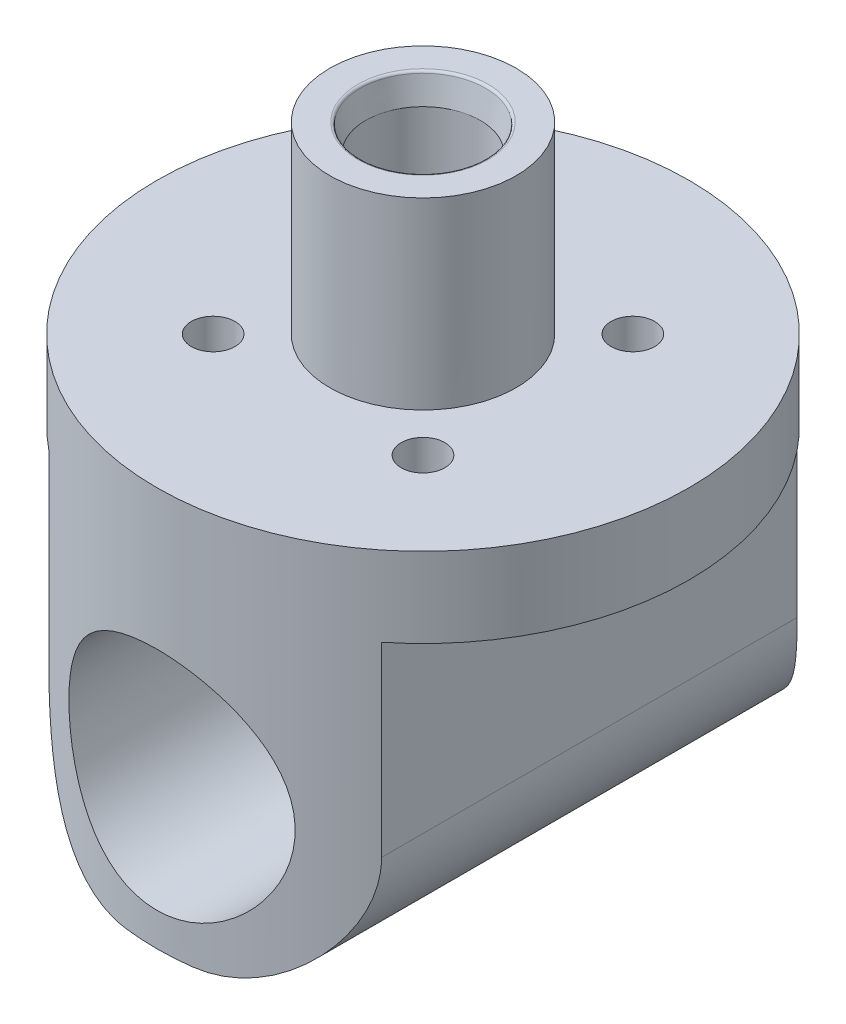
ISO-10303-21;
HEADER;
FILE_DESCRIPTION(('STEP AP214'),'2;1');
FILE_NAME('part.step','',(''),(''),'','','');
FILE_SCHEMA(('AUTOMOTIVE_DESIGN { 1 0 10303 214 1 1 1 1 }'));
ENDSEC;
DATA;
#1=APPLICATION_CONTEXT('core data for automotive mechanical design processes');
#2=APPLICATION_PROTOCOL_DEFINITION('international standard','automotive_design',2000,#1);
#3=PRODUCT_CONTEXT('',#1,'mechanical');
#4=PRODUCT('Part','Part','',(#3));
#5=PRODUCT_RELATED_PRODUCT_CATEGORY('part','',(#4));
#6=PRODUCT_DEFINITION_FORMATION('','',#4);
#7=PRODUCT_DEFINITION_CONTEXT('part definition',#1,'design');
#8=PRODUCT_DEFINITION('design','',#6,#7);
#9=PRODUCT_DEFINITION_SHAPE('','',#8);
#10=(LENGTH_UNIT() NAMED_UNIT(*) SI_UNIT(.MILLI.,.METRE.));
#11=(NAMED_UNIT(*) PLANE_ANGLE_UNIT() SI_UNIT($,.RADIAN.));
#12=(NAMED_UNIT(*) SI_UNIT($,.STERADIAN.) SOLID_ANGLE_UNIT());
#13=UNCERTAINTY_MEASURE_WITH_UNIT(LENGTH_MEASURE(1.E-05),#10,'distance_accuracy_value','');
#14=(GEOMETRIC_REPRESENTATION_CONTEXT(3) GLOBAL_UNCERTAINTY_ASSIGNED_CONTEXT((#13)) GLOBAL_UNIT_ASSIGNED_CONTEXT((#10,
#11,#12)) REPRESENTATION_CONTEXT('',''));
#15=CARTESIAN_POINT('',(0.,0.,0.));
#16=DIRECTION('',(0.,0.,1.));
#17=DIRECTION('',(1.,0.,0.));
#18=AXIS2_PLACEMENT_3D('',#15,#16,#17);
#19=CARTESIAN_POINT('',(0.,55.8196574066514,0.));
#20=DIRECTION('',(0.,1.,0.));
#21=DIRECTION('',(-1.,0.,0.));
#22=AXIS2_PLACEMENT_3D('',#19,#20,#21);
#23=CYLINDRICAL_SURFACE('',#22,8.89);
#24=CARTESIAN_POINT('',(0.,17.5259999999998,0.));
#25=DIRECTION('',(0.,-1.,0.));
#26=DIRECTION('',(0.,0.,-1.));
#27=AXIS2_PLACEMENT_3D('',#24,#25,#26);
#28=CIRCLE('',#27,8.89);
#29=CARTESIAN_POINT('',(0.,17.5259999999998,-8.89));
#30=VERTEX_POINT('',#29);
#31=EDGE_CURVE('E270',#30,#30,#28,.F.);
#32=ORIENTED_EDGE('',*,*,#31,.F.);
#33=EDGE_LOOP('',(#32));
#34=FACE_BOUND('',#33,.T.);
#35=CARTESIAN_POINT('',(0.,0.,0.));
#36=DIRECTION('',(0.,1.,0.));
#37=DIRECTION('',(-1.,0.,0.));
#38=AXIS2_PLACEMENT_3D('',#35,#36,#37);
#39=CIRCLE('',#38,8.89);
#40=CARTESIAN_POINT('',(-8.88999999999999,0.,0.));
#41=VERTEX_POINT('',#40);
#42=EDGE_CURVE('E288',#41,#41,#39,.T.);
#43=ORIENTED_EDGE('',*,*,#42,.T.);
#44=EDGE_LOOP('',(#43));
#45=FACE_BOUND('',#44,.T.);
#46=ADVANCED_FACE('F36',(#34,#45),#23,.T.);
#47=CARTESIAN_POINT('',(-25.4,0.,0.));
#48=DIRECTION('',(0.,1.,0.));
#49=DIRECTION('',(-1.,0.,0.));
#50=AXIS2_PLACEMENT_3D('',#47,#48,#49);
#51=PLANE('',#50);
#52=CARTESIAN_POINT('',(10.0129855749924,0.,10.0129855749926));
#53=DIRECTION('',(0.,1.,0.));
#54=DIRECTION('',(0.,0.,1.));
#55=AXIS2_PLACEMENT_3D('',#52,#53,#54);
#56=CIRCLE('',#55,2.0828);
#57=CARTESIAN_POINT('',(10.0129855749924,0.,12.0957855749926));
#58=VERTEX_POINT('',#57);
#59=EDGE_CURVE('E674',#58,#58,#56,.T.);
#60=ORIENTED_EDGE('',*,*,#59,.F.);
#61=EDGE_LOOP('',(#60));
#62=FACE_BOUND('',#61,.T.);
#63=CARTESIAN_POINT('',(10.0129855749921,0.,-10.0129855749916));
#64=DIRECTION('',(0.,1.,0.));
#65=DIRECTION('',(0.,0.,1.));
#66=AXIS2_PLACEMENT_3D('',#63,#64,#65);
#67=CIRCLE('',#66,2.0828);
#68=CARTESIAN_POINT('',(10.0129855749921,0.,-7.93018557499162));
#69=VERTEX_POINT('',#68);
#70=EDGE_CURVE('E110',#69,#69,#67,.T.);
#71=ORIENTED_EDGE('',*,*,#70,.F.);
#72=EDGE_LOOP('',(#71));
#73=FACE_BOUND('',#72,.T.);
#74=CARTESIAN_POINT('',(-10.0129855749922,0.,-10.0129855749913));
#75=DIRECTION('',(0.,1.,0.));
#76=DIRECTION('',(0.,0.,1.));
#77=AXIS2_PLACEMENT_3D('',#74,#75,#76);
#78=CIRCLE('',#77,2.0828);
#79=CARTESIAN_POINT('',(-10.0129855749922,0.,-7.93018557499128));
#80=VERTEX_POINT('',#79);
#81=EDGE_CURVE('E129',#80,#80,#78,.T.);
#82=ORIENTED_EDGE('',*,*,#81,.F.);
#83=EDGE_LOOP('',(#82));
#84=FACE_BOUND('',#83,.T.);
#85=CARTESIAN_POINT('',(-10.0129855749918,0.,10.012985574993));
#86=DIRECTION('',(0.,1.,0.));
#87=DIRECTION('',(0.,0.,1.));
#88=AXIS2_PLACEMENT_3D('',#85,#86,#87);
#89=CIRCLE('',#88,2.0828);
#90=CARTESIAN_POINT('',(-10.0129855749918,0.,12.0957855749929));
#91=VERTEX_POINT('',#90);
#92=EDGE_CURVE('E141',#91,#91,#89,.T.);
#93=ORIENTED_EDGE('',*,*,#92,.F.);
#94=EDGE_LOOP('',(#93));
#95=FACE_BOUND('',#94,.T.);
#96=CARTESIAN_POINT('',(0.,0.,0.));
#97=DIRECTION('',(0.,1.,0.));
#98=DIRECTION('',(-1.,0.,0.));
#99=AXIS2_PLACEMENT_3D('',#96,#97,#98);
#100=CIRCLE('',#99,25.4);
#101=CARTESIAN_POINT('',(-25.4,0.,0.));
#102=VERTEX_POINT('',#101);
#103=EDGE_CURVE('E294',#102,#102,#100,.T.);
#104=ORIENTED_EDGE('',*,*,#103,.T.);
#105=EDGE_LOOP('',(#104));
#106=FACE_BOUND('',#105,.T.);
#107=ORIENTED_EDGE('',*,*,#42,.F.);
#108=EDGE_LOOP('',(#107));
#109=FACE_BOUND('',#108,.T.);
#110=ADVANCED_FACE('F229',(#62,#73,#84,#95,#106,#109),#51,.T.);
#111=CARTESIAN_POINT('',(0.,55.8196574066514,0.));
#112=DIRECTION('',(0.,1.,0.));
#113=DIRECTION('',(-1.,0.,0.));
#114=AXIS2_PLACEMENT_3D('',#111,#112,#113);
#115=CYLINDRICAL_SURFACE('',#114,25.4);
#116=CARTESIAN_POINT('',(0.,-13.335,25.4));
#117=CARTESIAN_POINT('',(-0.288739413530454,-13.3350020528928,25.3999983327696));
#118=CARTESIAN_POINT('',(-0.577569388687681,-13.3466001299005,25.3950632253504));
#119=CARTESIAN_POINT('',(-1.15316629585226,-13.3928828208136,25.3754454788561));
#120=CARTESIAN_POINT('',(-1.4399318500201,-13.4275816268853,25.3607568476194));
#121=CARTESIAN_POINT('',(-2.00977306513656,-13.5198015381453,25.3219772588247));
#122=CARTESIAN_POINT('',(-2.29283934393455,-13.5773721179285,25.297865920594));
#123=CARTESIAN_POINT('',(-2.85263032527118,-13.71474191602,25.2408731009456));
#124=CARTESIAN_POINT('',(-3.12935458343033,-13.7945426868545,25.2079910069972));
#125=CARTESIAN_POINT('',(-3.6736279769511,-13.9752760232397,25.1344307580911));
#126=CARTESIAN_POINT('',(-3.94120616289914,-14.0761326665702,25.0937806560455));
#127=CARTESIAN_POINT('',(-4.46657466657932,-14.2982614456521,25.0056127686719));
#128=CARTESIAN_POINT('',(-4.72436464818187,-14.4195342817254,24.9580947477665));
#129=CARTESIAN_POINT('',(-5.22854725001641,-14.6814562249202,24.8573601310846));
#130=CARTESIAN_POINT('',(-5.47494598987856,-14.8220947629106,24.8041466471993));
#131=CARTESIAN_POINT('',(-5.95528589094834,-15.1218494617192,24.693224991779));
#132=CARTESIAN_POINT('',(-6.18922244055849,-15.2809723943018,24.6355151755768));
#133=CARTESIAN_POINT('',(-6.65405388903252,-15.6245316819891,24.5141580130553));
#134=CARTESIAN_POINT('',(-6.88429026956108,-15.8098057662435,24.4503591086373));
#135=CARTESIAN_POINT('',(-7.32861950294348,-16.1983852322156,24.3208741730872));
#136=CARTESIAN_POINT('',(-7.54270493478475,-16.4016988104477,24.255187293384));
#137=CARTESIAN_POINT('',(-7.95355181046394,-16.8252001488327,24.1235893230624));
#138=CARTESIAN_POINT('',(-8.15030779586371,-17.0453931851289,24.0576781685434));
#139=CARTESIAN_POINT('',(-8.52532151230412,-17.5014201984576,23.9273547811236));
#140=CARTESIAN_POINT('',(-8.70357922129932,-17.7372541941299,23.8629425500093));
#141=CARTESIAN_POINT('',(-9.04928630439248,-18.2360008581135,23.7340726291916));
#142=CARTESIAN_POINT('',(-9.21569064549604,-18.4996840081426,23.6697869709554));
#143=CARTESIAN_POINT('',(-9.52548755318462,-19.0413449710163,23.5468228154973));
#144=CARTESIAN_POINT('',(-9.66888966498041,-19.319316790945,23.4881419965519));
#145=CARTESIAN_POINT('',(-9.93147902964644,-19.8878578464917,23.3783230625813));
#146=CARTESIAN_POINT('',(-10.0506708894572,-20.1784246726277,23.3271835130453));
#147=CARTESIAN_POINT('',(-10.2636480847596,-20.7701770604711,23.2342645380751));
#148=CARTESIAN_POINT('',(-10.3574353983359,-21.0713617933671,23.1924843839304));
#149=CARTESIAN_POINT('',(-10.5145283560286,-21.6669108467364,23.1216727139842));
#150=CARTESIAN_POINT('',(-10.5791129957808,-21.9608748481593,23.092112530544));
#151=CARTESIAN_POINT('',(-10.6835898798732,-22.554052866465,23.0439630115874));
#152=CARTESIAN_POINT('',(-10.7234829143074,-22.8532667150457,23.0253733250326));
#153=CARTESIAN_POINT('',(-10.7780572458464,-23.4543320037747,22.999878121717));
#154=CARTESIAN_POINT('',(-10.7927511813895,-23.7561820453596,22.9929667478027));
#155=CARTESIAN_POINT('',(-10.7967703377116,-24.3600800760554,22.9910800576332));
#156=CARTESIAN_POINT('',(-10.7860969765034,-24.6621280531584,22.9961040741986));
#157=CARTESIAN_POINT('',(-10.7414113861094,-25.2395395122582,23.0170070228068));
#158=CARTESIAN_POINT('',(-10.7093515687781,-25.5150898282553,23.031977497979));
#159=CARTESIAN_POINT('',(-10.6242542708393,-26.0623431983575,23.0713549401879));
#160=CARTESIAN_POINT('',(-10.5712095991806,-26.3340449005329,23.0957651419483));
#161=CARTESIAN_POINT('',(-10.4446976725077,-26.8716341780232,23.1532525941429));
#162=CARTESIAN_POINT('',(-10.3712351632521,-27.1375230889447,23.1863278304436));
#163=CARTESIAN_POINT('',(-10.2045349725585,-27.6620321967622,23.2601756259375));
#164=CARTESIAN_POINT('',(-10.1112895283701,-27.9206494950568,23.300951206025));
#165=CARTESIAN_POINT('',(-9.90363775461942,-28.4344613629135,23.3899760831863));
#166=CARTESIAN_POINT('',(-9.78882458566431,-28.6894670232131,23.4383655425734));
#167=CARTESIAN_POINT('',(-9.54023320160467,-29.1890372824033,23.5406459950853));
#168=CARTESIAN_POINT('',(-9.4064467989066,-29.4335973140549,23.5945393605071));
#169=CARTESIAN_POINT('',(-9.12083079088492,-29.9109904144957,23.7064118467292));
#170=CARTESIAN_POINT('',(-8.96899928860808,-30.1438222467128,23.7643913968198));
#171=CARTESIAN_POINT('',(-8.64820078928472,-30.5966569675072,23.8830037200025));
#172=CARTESIAN_POINT('',(-8.47923279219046,-30.8166591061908,23.9436366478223));
#173=CARTESIAN_POINT('',(-8.10937222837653,-31.2616940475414,24.0715532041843));
#174=CARTESIAN_POINT('',(-7.90697768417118,-31.4854480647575,24.1389504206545));
#175=CARTESIAN_POINT('',(-7.4841920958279,-31.9152253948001,24.2733609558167));
#176=CARTESIAN_POINT('',(-7.26380669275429,-32.1212542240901,24.3403743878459));
#177=CARTESIAN_POINT('',(-6.80604657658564,-32.5145611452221,24.4723209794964));
#178=CARTESIAN_POINT('',(-6.56866106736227,-32.7018271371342,24.5372527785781));
#179=CARTESIAN_POINT('',(-6.07843644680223,-33.0561448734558,24.6632647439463));
#180=CARTESIAN_POINT('',(-5.82560359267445,-33.223204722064,24.7243464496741));
#181=CARTESIAN_POINT('',(-5.29928533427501,-33.5399032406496,24.842546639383));
#182=CARTESIAN_POINT('',(-5.02544000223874,-33.6889966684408,24.8995264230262));
#183=CARTESIAN_POINT('',(-4.46469356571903,-33.9634107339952,25.0061582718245));
#184=CARTESIAN_POINT('',(-4.1777921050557,-34.0887307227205,25.055810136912));
#185=CARTESIAN_POINT('',(-3.593093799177,-34.3142936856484,25.1463146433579));
#186=CARTESIAN_POINT('',(-3.29530208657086,-34.4145483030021,25.1871713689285));
#187=CARTESIAN_POINT('',(-2.69099563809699,-34.5889407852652,25.2588813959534));
#188=CARTESIAN_POINT('',(-2.38448159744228,-34.6630807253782,25.2897354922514));
#189=CARTESIAN_POINT('',(-1.78549145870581,-34.780399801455,25.3388308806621));
#190=CARTESIAN_POINT('',(-1.49340516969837,-34.8252841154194,25.3577640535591));
#191=CARTESIAN_POINT('',(-0.906061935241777,-34.8909657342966,25.385536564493));
#192=CARTESIAN_POINT('',(-0.610805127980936,-34.9117640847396,25.3943763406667));
#193=CARTESIAN_POINT('',(-0.0195308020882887,-34.9290323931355,25.4017128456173));
#194=CARTESIAN_POINT('',(0.276486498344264,-34.9255086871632,25.4002122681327));
#195=CARTESIAN_POINT('',(0.866996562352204,-34.8941885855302,25.386916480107));
#196=CARTESIAN_POINT('',(1.16148936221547,-34.8663927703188,25.3751215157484));
#197=CARTESIAN_POINT('',(1.73135804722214,-34.788928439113,25.3424460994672));
#198=CARTESIAN_POINT('',(2.00692964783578,-34.7404768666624,25.3220718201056));
#199=CARTESIAN_POINT('',(2.55275017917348,-34.6225423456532,25.2728816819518));
#200=CARTESIAN_POINT('',(2.82299934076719,-34.5530603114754,25.2440661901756));
#201=CARTESIAN_POINT('',(3.35642148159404,-34.3937194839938,25.1786941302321));
#202=CARTESIAN_POINT('',(3.61959517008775,-34.3038627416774,25.1421383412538));
#203=CARTESIAN_POINT('',(4.13741461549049,-34.1045093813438,25.0621323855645));
#204=CARTESIAN_POINT('',(4.39205706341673,-33.9950052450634,25.018679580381));
#205=CARTESIAN_POINT('',(4.89900362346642,-33.7535648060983,24.9244505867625));
#206=CARTESIAN_POINT('',(5.1509942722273,-33.6210415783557,24.8734900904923));
#207=CARTESIAN_POINT('',(5.64298089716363,-33.3370385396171,24.7665149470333));
#208=CARTESIAN_POINT('',(5.88297240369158,-33.1855517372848,24.7104984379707));
#209=CARTESIAN_POINT('',(6.58300163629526,-32.7041806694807,24.5368030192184));
#210=CARTESIAN_POINT('',(7.02338064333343,-32.3472484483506,24.4134226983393));
#211=CARTESIAN_POINT('',(7.87288492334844,-31.5406470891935,24.153462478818));
#212=CARTESIAN_POINT('',(8.27726615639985,-31.0860618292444,24.0165824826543));
#213=CARTESIAN_POINT('',(8.82312146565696,-30.3571211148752,23.8191133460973));
#214=CARTESIAN_POINT('',(8.99504996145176,-30.1061104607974,23.7545575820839));
#215=CARTESIAN_POINT('',(9.31752050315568,-29.5897044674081,23.6299310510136));
#216=CARTESIAN_POINT('',(9.46807161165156,-29.3243152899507,23.5698583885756));
#217=CARTESIAN_POINT('',(9.74904675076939,-28.7759332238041,23.4550538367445));
#218=CARTESIAN_POINT('',(9.87907575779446,-28.4927146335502,23.4004328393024));
#219=CARTESIAN_POINT('',(10.1145308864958,-27.9149103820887,23.2996281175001));
#220=CARTESIAN_POINT('',(10.219968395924,-27.6203300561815,23.2534404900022));
#221=CARTESIAN_POINT('',(10.4051244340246,-27.0219615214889,23.1711817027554));
#222=CARTESIAN_POINT('',(10.4848554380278,-26.7181778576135,23.1351056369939));
#223=CARTESIAN_POINT('',(10.6176843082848,-26.1037204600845,23.0744476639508));
#224=CARTESIAN_POINT('',(10.6707848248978,-25.7930474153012,23.0498646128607));
#225=CARTESIAN_POINT('',(10.7465148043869,-25.192388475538,23.0146476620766));
#226=CARTESIAN_POINT('',(10.7712298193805,-24.9027198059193,23.0030607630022));
#227=CARTESIAN_POINT('',(10.7972010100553,-24.3221074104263,22.9908822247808));
#228=CARTESIAN_POINT('',(10.7984584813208,-24.0311637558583,22.9902899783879));
#229=CARTESIAN_POINT('',(10.7775020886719,-23.4503598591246,23.0001212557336));
#230=CARTESIAN_POINT('',(10.7552917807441,-23.160499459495,23.0105431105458));
#231=CARTESIAN_POINT('',(10.6876744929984,-22.5840885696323,23.0420268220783));
#232=CARTESIAN_POINT('',(10.6422677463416,-22.2975380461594,23.0630885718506));
#233=CARTESIAN_POINT('',(10.5316629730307,-21.7442903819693,23.1137960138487));
#234=CARTESIAN_POINT('',(10.4675846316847,-21.4773230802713,23.1429525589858));
#235=CARTESIAN_POINT('',(10.3195886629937,-20.9498794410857,23.2093227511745));
#236=CARTESIAN_POINT('',(10.2356642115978,-20.6894053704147,23.2465391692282));
#237=CARTESIAN_POINT('',(10.0487171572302,-20.1765448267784,23.3279589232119));
#238=CARTESIAN_POINT('',(9.94569468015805,-19.9241583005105,23.3721622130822));
#239=CARTESIAN_POINT('',(9.7213380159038,-19.4287700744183,23.4663670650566));
#240=CARTESIAN_POINT('',(9.60000211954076,-19.1857692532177,23.5163691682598));
#241=CARTESIAN_POINT('',(9.33185396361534,-18.6957336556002,23.6241112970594));
#242=CARTESIAN_POINT('',(9.1839348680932,-18.449367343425,23.682137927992));
#243=CARTESIAN_POINT('',(8.86939100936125,-17.9697912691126,23.801726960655));
#244=CARTESIAN_POINT('',(8.70276564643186,-17.736581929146,23.8632894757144));
#245=CARTESIAN_POINT('',(8.35174198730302,-17.2843898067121,23.9883956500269));
#246=CARTESIAN_POINT('',(8.16733800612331,-17.0654116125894,24.0519399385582));
#247=CARTESIAN_POINT('',(7.78179795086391,-16.6428475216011,24.1794301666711));
#248=CARTESIAN_POINT('',(7.58066169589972,-16.4392617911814,24.2433761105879));
#249=CARTESIAN_POINT('',(7.14648303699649,-16.0334079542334,24.3750513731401));
#250=CARTESIAN_POINT('',(6.91217607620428,-15.8324606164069,24.4426905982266));
#251=CARTESIAN_POINT('',(6.42673787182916,-15.4510416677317,24.5747896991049));
#252=CARTESIAN_POINT('',(6.1756121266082,-15.2705634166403,24.6392506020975));
#253=CARTESIAN_POINT('',(5.6577439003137,-14.9312034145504,24.7632967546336));
#254=CARTESIAN_POINT('',(5.39099027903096,-14.7723373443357,24.82287845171));
#255=CARTESIAN_POINT('',(4.84370643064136,-14.4776893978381,24.935447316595));
#256=CARTESIAN_POINT('',(4.56317731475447,-14.3419056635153,24.9884350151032));
#257=CARTESIAN_POINT('',(3.99453046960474,-14.0965464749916,25.0855667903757));
#258=CARTESIAN_POINT('',(3.70659064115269,-13.986607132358,25.1298320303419));
#259=CARTESIAN_POINT('',(3.12123231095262,-13.7914756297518,25.2092266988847));
#260=CARTESIAN_POINT('',(2.82381479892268,-13.7062808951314,25.2443570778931));
#261=CARTESIAN_POINT('',(2.22259274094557,-13.5617713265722,25.3043696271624));
#262=CARTESIAN_POINT('',(1.91880723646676,-13.5023884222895,25.3292787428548));
#263=CARTESIAN_POINT('',(1.30672459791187,-13.4099174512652,25.3682157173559));
#264=CARTESIAN_POINT('',(0.998430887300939,-13.3768103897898,25.3822514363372));
#265=CARTESIAN_POINT('',(0.574547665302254,-13.3496868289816,25.3937610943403));
#266=CARTESIAN_POINT('',(0.45972489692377,-13.3441809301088,25.3960992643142));
#267=CARTESIAN_POINT('',(0.229939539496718,-13.336837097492,25.3992190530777));
#268=CARTESIAN_POINT('',(0.114976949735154,-13.3349991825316,25.4000006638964));
#269=CARTESIAN_POINT('',(0.,-13.335,25.4));
#270=B_SPLINE_CURVE_WITH_KNOTS('',3,(#116,#117,#118,#119,#120,#121,#122,#123,#124,#125,#126,
#127,#128,#129,#130,#131,#132,#133,#134,#135,#136,#137,#138,#139,#140,#141,#142,#143,#144,#145,
#146,#147,#148,#149,#150,#151,#152,#153,#154,#155,#156,#157,#158,#159,#160,#161,#162,#163,#164,
#165,#166,#167,#168,#169,#170,#171,#172,#173,#174,#175,#176,#177,#178,#179,#180,#181,#182,#183,
#184,#185,#186,#187,#188,#189,#190,#191,#192,#193,#194,#195,#196,#197,#198,#199,#200,#201,#202,
#203,#204,#205,#206,#207,#208,#209,#210,#211,#212,#213,#214,#215,#216,#217,#218,#219,#220,#221,
#222,#223,#224,#225,#226,#227,#228,#229,#230,#231,#232,#233,#234,#235,#236,#237,#238,#239,#240,
#241,#242,#243,#244,#245,#246,#247,#248,#249,#250,#251,#252,#253,#254,#255,#256,#257,#258,#259,
#260,#261,#262,#263,#264,#265,#266,#267,#268,#269),.UNSPECIFIED.,.T.,.F.,(4,2,2,2,2,2,2,2,2,2,2,
2,2,2,2,2,2,2,2,2,2,2,2,2,2,2,2,2,2,2,2,2,2,2,2,2,2,2,2,2,2,2,2,2,2,2,2,2,2,2,2,2,2,2,2,2,2,2,2,
2,2,2,2,2,2,2,2,2,2,2,2,2,2,2,2,2,4),(0.,0.86610174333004,1.73273607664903,2.60125534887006,
3.46983529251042,4.33533583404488,5.20086607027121,6.06592578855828,6.931303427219,
7.83731213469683,8.74373462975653,9.6504416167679,10.5571496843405,11.5110371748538,
12.4645278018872,13.4178368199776,14.3710715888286,15.2771232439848,16.1831459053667,
17.0887140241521,17.9942315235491,18.8266934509,19.6594408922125,20.4919949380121,
21.3248762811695,22.1754213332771,23.0263345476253,23.8773372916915,24.7283897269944,
25.6547825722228,26.5808860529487,27.5075829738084,28.4339069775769,29.3835793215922,
30.3332775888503,31.2825338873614,32.2317147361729,33.1189329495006,34.0061126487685,
34.8930612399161,35.7799886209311,36.6206381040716,37.461251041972,38.3017793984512,
39.1426300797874,40.0093732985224,40.8764370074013,42.6096075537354,44.4713873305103,
45.4035450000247,46.3353063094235,47.2832520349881,48.2307579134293,49.1778032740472,
50.1247543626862,50.9964782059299,51.8681539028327,52.7396975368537,53.6112324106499,
54.4385965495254,55.266245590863,56.0938891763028,56.9216100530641,57.8001544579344,
58.6787270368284,59.5575814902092,60.4364454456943,61.3833107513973,62.3298680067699,
63.2771084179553,64.2242725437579,65.1571728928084,66.0899761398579,67.0203042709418,
67.9499592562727,68.2948419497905,68.6397264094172),.UNSPECIFIED.);
#271=CARTESIAN_POINT('',(0.,-13.335,25.4));
#272=VERTEX_POINT('',#271);
#273=EDGE_CURVE('E161',#272,#272,#270,.T.);
#274=ORIENTED_EDGE('',*,*,#273,.F.);
#275=EDGE_LOOP('',(#274));
#276=FACE_BOUND('',#275,.T.);
#277=CARTESIAN_POINT('',(-10.795,-24.13,-22.9919110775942));
#278=CARTESIAN_POINT('',(-10.7949978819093,-23.8425896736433,-22.9919133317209));
#279=CARTESIAN_POINT('',(-10.7835052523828,-23.5550841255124,-22.9973188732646));
#280=CARTESIAN_POINT('',(-10.7376532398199,-22.9821746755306,-23.0187624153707));
#281=CARTESIAN_POINT('',(-10.7032793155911,-22.6967722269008,-23.0348071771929));
#282=CARTESIAN_POINT('',(-10.6119492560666,-22.129697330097,-23.0770246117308));
#283=CARTESIAN_POINT('',(-10.5549424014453,-21.8480347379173,-23.1032200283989));
#284=CARTESIAN_POINT('',(-10.4189634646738,-21.2910890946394,-23.1648604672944));
#285=CARTESIAN_POINT('',(-10.3399894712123,-21.0158066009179,-23.2003062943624));
#286=CARTESIAN_POINT('',(-10.1612486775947,-20.4746043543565,-23.2791433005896));
#287=CARTESIAN_POINT('',(-10.0615729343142,-20.2086493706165,-23.3224995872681));
#288=CARTESIAN_POINT('',(-9.84209316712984,-19.6864133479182,-23.4159650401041));
#289=CARTESIAN_POINT('',(-9.72228844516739,-19.4301326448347,-23.4660744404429));
#290=CARTESIAN_POINT('',(-9.4635331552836,-18.9287386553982,-23.5716152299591));
#291=CARTESIAN_POINT('',(-9.32459148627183,-18.6836202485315,-23.6270441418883));
#292=CARTESIAN_POINT('',(-9.02840585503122,-18.2055579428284,-23.741800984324));
#293=CARTESIAN_POINT('',(-8.8711556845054,-17.9726182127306,-23.8011302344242));
#294=CARTESIAN_POINT('',(-8.52958229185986,-17.5068227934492,-23.9257429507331));
#295=CARTESIAN_POINT('',(-8.34421224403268,-17.2747729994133,-23.9911715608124));
#296=CARTESIAN_POINT('',(-7.9551436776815,-16.8268691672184,-24.1229739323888));
#297=CARTESIAN_POINT('',(-7.7514445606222,-16.6110156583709,-24.1893477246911));
#298=CARTESIAN_POINT('',(-7.32672108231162,-16.196572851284,-24.3213616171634));
#299=CARTESIAN_POINT('',(-7.10568705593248,-15.9979933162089,-24.3870012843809));
#300=CARTESIAN_POINT('',(-6.64765372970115,-15.619479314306,-24.5158168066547));
#301=CARTESIAN_POINT('',(-6.41065997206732,-15.439538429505,-24.5789935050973));
#302=CARTESIAN_POINT('',(-5.91071365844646,-15.0916139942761,-24.7041058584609));
#303=CARTESIAN_POINT('',(-5.64706952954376,-14.9245541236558,-24.7658525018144));
#304=CARTESIAN_POINT('',(-5.10524266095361,-14.6133764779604,-24.8831936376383));
#305=CARTESIAN_POINT('',(-4.82705935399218,-14.4692595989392,-24.9387878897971));
#306=CARTESIAN_POINT('',(-4.25810803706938,-14.2053419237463,-25.0422058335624));
#307=CARTESIAN_POINT('',(-3.96734458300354,-14.085532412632,-25.0900323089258));
#308=CARTESIAN_POINT('',(-3.37525782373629,-13.8714064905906,-25.1765190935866));
#309=CARTESIAN_POINT('',(-3.07393529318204,-13.7770882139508,-25.2151800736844));
#310=CARTESIAN_POINT('',(-2.47956686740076,-13.6193789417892,-25.2803532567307));
#311=CARTESIAN_POINT('',(-2.18694958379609,-13.5545955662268,-25.3074077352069));
#312=CARTESIAN_POINT('',(-1.59660254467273,-13.449515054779,-25.3514980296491));
#313=CARTESIAN_POINT('',(-1.29887295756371,-13.4092171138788,-25.3685341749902));
#314=CARTESIAN_POINT('',(-0.70078335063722,-13.3535859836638,-25.3920940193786));
#315=CARTESIAN_POINT('',(-0.400424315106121,-13.3382438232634,-25.3986214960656));
#316=CARTESIAN_POINT('',(0.200562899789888,-13.3326812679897,-25.4009853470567));
#317=CARTESIAN_POINT('',(0.501191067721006,-13.3424598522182,-25.3968221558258));
#318=CARTESIAN_POINT('',(1.08124952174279,-13.3856024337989,-25.3785285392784));
#319=CARTESIAN_POINT('',(1.36081597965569,-13.4174327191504,-25.3650463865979));
#320=CARTESIAN_POINT('',(1.91603928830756,-13.5026910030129,-25.3291566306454));
#321=CARTESIAN_POINT('',(2.19169633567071,-13.5561179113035,-25.3067494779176));
#322=CARTESIAN_POINT('',(2.73725216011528,-13.68404463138,-25.2535656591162));
#323=CARTESIAN_POINT('',(3.00715073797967,-13.7585451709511,-25.22278870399));
#324=CARTESIAN_POINT('',(3.53946737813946,-13.9279307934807,-25.1536124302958));
#325=CARTESIAN_POINT('',(3.80188521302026,-14.0228164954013,-25.115212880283));
#326=CARTESIAN_POINT('',(4.32156312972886,-14.2337411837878,-25.0310691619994));
#327=CARTESIAN_POINT('',(4.57868600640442,-14.3500772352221,-24.9852230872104));
#328=CARTESIAN_POINT('',(5.08224861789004,-14.6020372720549,-24.8876787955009));
#329=CARTESIAN_POINT('',(5.32868448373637,-14.7376681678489,-24.835978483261));
#330=CARTESIAN_POINT('',(5.80951062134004,-15.0272322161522,-24.7279258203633));
#331=CARTESIAN_POINT('',(6.04389973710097,-15.1811671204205,-24.6715730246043));
#332=CARTESIAN_POINT('',(6.49946437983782,-15.5063510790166,-24.5554928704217));
#333=CARTESIAN_POINT('',(6.72063912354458,-15.6776011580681,-24.4957653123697));
#334=CARTESIAN_POINT('',(7.16434462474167,-16.0495303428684,-24.369841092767));
#335=CARTESIAN_POINT('',(7.38579722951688,-16.2514449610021,-24.3034903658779));
#336=CARTESIAN_POINT('',(7.81107503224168,-16.6728720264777,-24.1701630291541));
#337=CARTESIAN_POINT('',(8.01489950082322,-16.8923852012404,-24.103186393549));
#338=CARTESIAN_POINT('',(8.40383555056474,-17.3478701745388,-23.9703524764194));
#339=CARTESIAN_POINT('',(8.58894051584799,-17.5838477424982,-23.9044955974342));
#340=CARTESIAN_POINT('',(8.93923862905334,-18.0709534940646,-23.7757197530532));
#341=CARTESIAN_POINT('',(9.10442932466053,-18.3220835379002,-23.7128011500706));
#342=CARTESIAN_POINT('',(9.41925528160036,-18.8473203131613,-23.5895576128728));
#343=CARTESIAN_POINT('',(9.56812573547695,-19.1219270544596,-23.5294051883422));
#344=CARTESIAN_POINT('',(9.84193155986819,-19.6840909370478,-23.4161981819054));
#345=CARTESIAN_POINT('',(9.96687739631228,-19.9716423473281,-23.3631404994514));
#346=CARTESIAN_POINT('',(10.1916426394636,-20.557758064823,-23.2659713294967));
#347=CARTESIAN_POINT('',(10.2914715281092,-20.8563181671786,-23.2218564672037));
#348=CARTESIAN_POINT('',(10.4649258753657,-21.462295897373,-23.1442083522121));
#349=CARTESIAN_POINT('',(10.5385537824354,-21.7697126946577,-23.110674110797));
#350=CARTESIAN_POINT('',(10.6546719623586,-22.3701263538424,-23.057358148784));
#351=CARTESIAN_POINT('',(10.698911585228,-22.6627173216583,-23.0368083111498));
#352=CARTESIAN_POINT('',(10.7632311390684,-23.2511092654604,-23.0068278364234));
#353=CARTESIAN_POINT('',(10.7833121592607,-23.5469100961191,-22.997396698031));
#354=CARTESIAN_POINT('',(10.7990593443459,-24.1392081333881,-22.9900063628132));
#355=CARTESIAN_POINT('',(10.7947333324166,-24.4357050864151,-22.9920434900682));
#356=CARTESIAN_POINT('',(10.7617393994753,-25.0270348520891,-23.0075052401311));
#357=CARTESIAN_POINT('',(10.7330722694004,-25.3218677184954,-23.0209294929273));
#358=CARTESIAN_POINT('',(10.6545309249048,-25.8875274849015,-23.0573782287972));
#359=CARTESIAN_POINT('',(10.6062339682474,-26.1586218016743,-23.0796866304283));
#360=CARTESIAN_POINT('',(10.4892924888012,-26.6955988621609,-23.1330687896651));
#361=CARTESIAN_POINT('',(10.4206409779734,-26.9614797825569,-23.1641455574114));
#362=CARTESIAN_POINT('',(10.2636586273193,-27.486237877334,-23.2341275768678));
#363=CARTESIAN_POINT('',(10.1753316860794,-27.7451164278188,-23.2730312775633));
#364=CARTESIAN_POINT('',(9.97970231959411,-28.2545673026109,-23.3575874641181));
#365=CARTESIAN_POINT('',(9.87239246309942,-28.5051363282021,-23.4032425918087));
#366=CARTESIAN_POINT('',(9.63464944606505,-29.0070823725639,-23.5021445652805));
#367=CARTESIAN_POINT('',(9.50342433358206,-29.2580366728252,-23.5556323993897));
#368=CARTESIAN_POINT('',(9.22212256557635,-29.7482181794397,-23.6671787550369));
#369=CARTESIAN_POINT('',(9.07203763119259,-29.9874401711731,-23.725239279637));
#370=CARTESIAN_POINT('',(8.75397737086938,-30.4529247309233,-23.8444274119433));
#371=CARTESIAN_POINT('',(8.58599916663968,-30.6791852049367,-23.9055555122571));
#372=CARTESIAN_POINT('',(8.23311010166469,-31.1176409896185,-24.0293750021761));
#373=CARTESIAN_POINT('',(8.04819845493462,-31.3298356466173,-24.0920664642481));
#374=CARTESIAN_POINT('',(7.6458535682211,-31.7566747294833,-24.2229108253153));
#375=CARTESIAN_POINT('',(7.42699135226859,-31.9699723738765,-24.2910716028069));
#376=CARTESIAN_POINT('',(6.97175303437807,-32.3774220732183,-24.4256212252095));
#377=CARTESIAN_POINT('',(6.73538281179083,-32.5715805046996,-24.49201065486));
#378=CARTESIAN_POINT('',(6.24625928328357,-32.93965332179,-24.6212967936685));
#379=CARTESIAN_POINT('',(5.99349744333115,-33.1135570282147,-24.6841916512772));
#380=CARTESIAN_POINT('',(5.47328498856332,-33.4396384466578,-24.8047252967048));
#381=CARTESIAN_POINT('',(5.20584080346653,-33.5918255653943,-24.8623663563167));
#382=CARTESIAN_POINT('',(4.65658961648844,-33.8739175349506,-24.9710809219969));
#383=CARTESIAN_POINT('',(4.37472370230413,-34.0037196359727,-25.0221238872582));
#384=CARTESIAN_POINT('',(3.79964598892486,-34.2389673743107,-25.1158824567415));
#385=CARTESIAN_POINT('',(3.50643404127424,-34.3444126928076,-25.1585979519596));
#386=CARTESIAN_POINT('',(2.91099344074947,-34.529774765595,-25.2344236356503));
#387=CARTESIAN_POINT('',(2.60876947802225,-34.6097045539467,-25.2675387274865));
#388=CARTESIAN_POINT('',(1.99759743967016,-34.7431730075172,-25.3231855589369));
#389=CARTESIAN_POINT('',(1.68864989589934,-34.7967137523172,-25.3457181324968));
#390=CARTESIAN_POINT('',(1.08915437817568,-34.8738540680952,-25.3782831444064));
#391=CARTESIAN_POINT('',(0.798890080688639,-34.8993376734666,-25.3891012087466));
#392=CARTESIAN_POINT('',(0.217057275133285,-34.9267456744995,-25.4007388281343));
#393=CARTESIAN_POINT('',(-0.0745111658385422,-34.9286712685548,-25.4015588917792));
#394=CARTESIAN_POINT('',(-0.65665123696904,-34.9089444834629,-25.3931790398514));
#395=CARTESIAN_POINT('',(-0.94722302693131,-34.8872960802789,-25.3839808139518));
#396=CARTESIAN_POINT('',(-1.52519638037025,-34.82066984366,-25.3558175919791));
#397=CARTESIAN_POINT('',(-1.8125979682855,-34.7756921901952,-25.3368526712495));
#398=CARTESIAN_POINT('',(-2.37123909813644,-34.6650473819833,-25.2905670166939));
#399=CARTESIAN_POINT('',(-2.64267719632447,-34.6002338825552,-25.2635922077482));
#400=CARTESIAN_POINT('',(-3.17887871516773,-34.4500904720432,-25.2017373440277));
#401=CARTESIAN_POINT('',(-3.44364236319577,-34.3647612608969,-25.1668575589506));
#402=CARTESIAN_POINT('',(-3.96487860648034,-34.1743392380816,-25.0900207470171));
#403=CARTESIAN_POINT('',(-4.2213516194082,-34.0692474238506,-25.0480640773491));
#404=CARTESIAN_POINT('',(-4.72467202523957,-33.8400976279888,-24.9580221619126));
#405=CARTESIAN_POINT('',(-4.97151564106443,-33.7160322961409,-24.9099345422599));
#406=CARTESIAN_POINT('',(-5.46507866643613,-33.443855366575,-24.8064372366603));
#407=CARTESIAN_POINT('',(-5.71129048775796,-33.2949116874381,-24.7507951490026));
#408=CARTESIAN_POINT('',(-6.19047826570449,-32.9783056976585,-24.6353152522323));
#409=CARTESIAN_POINT('',(-6.42344826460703,-32.810635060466,-24.5754755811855));
#410=CARTESIAN_POINT('',(-6.87489025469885,-32.4576656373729,-24.4530282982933));
#411=CARTESIAN_POINT('',(-7.093360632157,-32.2723648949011,-24.3904203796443));
#412=CARTESIAN_POINT('',(-7.51470093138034,-31.8852021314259,-24.2639169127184));
#413=CARTESIAN_POINT('',(-7.71757023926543,-31.6833394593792,-24.2000213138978));
#414=CARTESIAN_POINT('',(-8.12061104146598,-31.2491017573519,-24.0679000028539));
#415=CARTESIAN_POINT('',(-8.31955160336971,-31.0155770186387,-23.9996914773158));
#416=CARTESIAN_POINT('',(-8.69705485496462,-30.5321317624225,-23.8654848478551));
#417=CARTESIAN_POINT('',(-8.87562410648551,-30.2822165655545,-23.7994860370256));
#418=CARTESIAN_POINT('',(-9.2113869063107,-29.7671062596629,-23.6715581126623));
#419=CARTESIAN_POINT('',(-9.36856256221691,-29.5018986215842,-23.6096324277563));
#420=CARTESIAN_POINT('',(-9.66012596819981,-28.9579598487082,-23.4918432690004));
#421=CARTESIAN_POINT('',(-9.79451530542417,-28.6792296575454,-23.4359793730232));
#422=CARTESIAN_POINT('',(-10.0389705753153,-28.1107726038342,-23.3323094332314));
#423=CARTESIAN_POINT('',(-10.149102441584,-27.8210781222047,-23.2844816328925));
#424=CARTESIAN_POINT('',(-10.3443603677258,-27.2320126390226,-23.1983967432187));
#425=CARTESIAN_POINT('',(-10.4294894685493,-26.9326428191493,-23.1601384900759));
#426=CARTESIAN_POINT('',(-10.5735529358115,-26.3273882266,-23.0947229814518));
#427=CARTESIAN_POINT('',(-10.6325611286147,-26.0215244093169,-23.0675344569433));
#428=CARTESIAN_POINT('',(-10.7239387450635,-25.4051794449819,-23.025197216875));
#429=CARTESIAN_POINT('',(-10.7563286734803,-25.0947020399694,-23.0100392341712));
#430=CARTESIAN_POINT('',(-10.781804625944,-24.674613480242,-22.998102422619));
#431=CARTESIAN_POINT('',(-10.7867513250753,-24.5657680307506,-22.995782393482));
#432=CARTESIAN_POINT('',(-10.7933494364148,-24.3479529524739,-22.9926862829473));
#433=CARTESIAN_POINT('',(-10.7950008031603,-24.2389833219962,-22.9919102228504));
#434=CARTESIAN_POINT('',(-10.795,-24.13,-22.9919110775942));
#435=B_SPLINE_CURVE_WITH_KNOTS('',3,(#277,#278,#279,#280,#281,#282,#283,#284,#285,#286,#287,
#288,#289,#290,#291,#292,#293,#294,#295,#296,#297,#298,#299,#300,#301,#302,#303,#304,#305,#306,
#307,#308,#309,#310,#311,#312,#313,#314,#315,#316,#317,#318,#319,#320,#321,#322,#323,#324,#325,
#326,#327,#328,#329,#330,#331,#332,#333,#334,#335,#336,#337,#338,#339,#340,#341,#342,#343,#344,
#345,#346,#347,#348,#349,#350,#351,#352,#353,#354,#355,#356,#357,#358,#359,#360,#361,#362,#363,
#364,#365,#366,#367,#368,#369,#370,#371,#372,#373,#374,#375,#376,#377,#378,#379,#380,#381,#382,
#383,#384,#385,#386,#387,#388,#389,#390,#391,#392,#393,#394,#395,#396,#397,#398,#399,#400,#401,
#402,#403,#404,#405,#406,#407,#408,#409,#410,#411,#412,#413,#414,#415,#416,#417,#418,#419,#420,
#421,#422,#423,#424,#425,#426,#427,#428,#429,#430,#431,#432,#433,#434),.UNSPECIFIED.,.T.,.F.,(4,
2,2,2,2,2,2,2,2,2,2,2,2,2,2,2,2,2,2,2,2,2,2,2,2,2,2,2,2,2,2,2,2,2,2,2,2,2,2,2,2,2,2,2,2,2,2,2,2,
2,2,2,2,2,2,2,2,2,2,2,2,2,2,2,2,2,2,2,2,2,2,2,2,2,2,2,2,2,4),(0.,0.862117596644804,
1.7247835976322,2.58939380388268,3.45407926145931,4.3150390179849,5.17602863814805,
6.03661923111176,6.89750249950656,7.80886698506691,8.72026124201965,9.6321673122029,
10.5437583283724,11.4970547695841,12.450388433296,13.4033796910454,14.3563011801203,
15.2578870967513,16.1594433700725,17.0606754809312,17.9618709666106,18.8059636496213,
19.650013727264,20.49409295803,21.3381978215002,22.1950156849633,23.0521411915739,
23.9093487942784,24.7666071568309,25.6864038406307,26.6062385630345,27.5263972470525,
28.4466691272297,29.3997591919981,30.3524313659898,31.3047433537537,32.2569663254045,
33.1456745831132,34.0343427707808,34.9227261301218,35.8110806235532,36.638934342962,
37.4670726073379,38.2950469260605,39.1233460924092,39.987028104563,40.8510905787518,
41.7152922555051,42.5795340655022,43.5177971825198,44.4557466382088,45.3941884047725,
46.3322224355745,47.2744537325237,48.216697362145,49.1584588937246,50.1001461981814,
50.9737851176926,51.8473795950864,52.7208267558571,53.5942671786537,54.434426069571,
55.2745563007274,56.1146441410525,56.9550582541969,57.8333714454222,58.7120767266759,
59.5908796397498,60.4697171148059,61.4114169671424,62.3528126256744,63.2949908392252,
64.2371033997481,65.176622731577,66.1160277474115,67.0527604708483,67.9887709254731,
68.3156733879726,68.6425803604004),.UNSPECIFIED.);
#436=CARTESIAN_POINT('',(-10.795,-24.13,-22.9919110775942));
#437=VERTEX_POINT('',#436);
#438=EDGE_CURVE('E154',#437,#437,#435,.T.);
#439=ORIENTED_EDGE('',*,*,#438,.F.);
#440=EDGE_LOOP('',(#439));
#441=FACE_BOUND('',#440,.T.);
#442=DIRECTION('',(0.,1.,0.));
#443=VECTOR('',#442,1.);
#444=CARTESIAN_POINT('',(15.875,55.8196574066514,-19.8278686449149));
#445=LINE('',#444,#443);
#446=CARTESIAN_POINT('',(15.875,-25.4,-19.8278686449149));
#447=VERTEX_POINT('',#446);
#448=CARTESIAN_POINT('',(15.875,-7.61999999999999,-19.8278686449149));
#449=VERTEX_POINT('',#448);
#450=EDGE_CURVE('E327',#447,#449,#445,.T.);
#451=ORIENTED_EDGE('',*,*,#450,.F.);
#452=CARTESIAN_POINT('',(15.875,-25.4,-19.8278686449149));
#453=CARTESIAN_POINT('',(15.875002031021,-25.557554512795,-19.8278635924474));
#454=CARTESIAN_POINT('',(15.8720673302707,-25.715084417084,-19.830217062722));
#455=CARTESIAN_POINT('',(15.8603525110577,-26.0297769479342,-19.8395892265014));
#456=CARTESIAN_POINT('',(15.8515728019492,-26.1869395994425,-19.8466075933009));
#457=CARTESIAN_POINT('',(15.8165364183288,-26.6570461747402,-19.8745598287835));
#458=CARTESIAN_POINT('',(15.7815823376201,-26.968998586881,-19.9023910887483));
#459=CARTESIAN_POINT('',(15.6895026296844,-27.5848122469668,-19.9750563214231));
#460=CARTESIAN_POINT('',(15.6325650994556,-27.8887193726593,-20.0197459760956));
#461=CARTESIAN_POINT('',(15.4974270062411,-28.4890930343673,-20.1245386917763));
#462=CARTESIAN_POINT('',(15.4192221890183,-28.785558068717,-20.1846448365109));
#463=CARTESIAN_POINT('',(15.2429734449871,-29.3681583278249,-20.3180681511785));
#464=CARTESIAN_POINT('',(15.1450064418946,-29.6543286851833,-20.391333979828));
#465=CARTESIAN_POINT('',(14.9302124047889,-30.2161724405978,-20.5491253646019));
#466=CARTESIAN_POINT('',(14.8133859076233,-30.4918461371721,-20.6336506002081));
#467=CARTESIAN_POINT('',(14.4355914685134,-31.302964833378,-20.9014058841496));
#468=CARTESIAN_POINT('',(14.1475852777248,-31.8216071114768,-21.0985981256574));
#469=CARTESIAN_POINT('',(13.6478644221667,-32.5915613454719,-21.4229315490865));
#470=CARTESIAN_POINT('',(13.4578942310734,-32.860563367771,-21.5429786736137));
#471=CARTESIAN_POINT('',(13.0586392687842,-33.3819405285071,-21.787304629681));
#472=CARTESIAN_POINT('',(12.8493533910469,-33.6343147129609,-21.9115837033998));
#473=CARTESIAN_POINT('',(12.412335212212,-34.1217471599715,-22.1620715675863));
#474=CARTESIAN_POINT('',(12.1845935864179,-34.356796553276,-22.2882813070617));
#475=CARTESIAN_POINT('',(11.711579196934,-34.8087097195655,-22.5404251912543));
#476=CARTESIAN_POINT('',(11.4663053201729,-35.0255723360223,-22.6663593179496));
#477=CARTESIAN_POINT('',(10.9190580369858,-35.47289880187,-22.9355864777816));
#478=CARTESIAN_POINT('',(10.6142347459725,-35.7001360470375,-23.0784939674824));
#479=CARTESIAN_POINT('',(10.1412955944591,-36.0205934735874,-23.2882785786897));
#480=CARTESIAN_POINT('',(9.98101553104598,-36.1240219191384,-23.3574505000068));
#481=CARTESIAN_POINT('',(9.65532284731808,-36.3239159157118,-23.4939551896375));
#482=CARTESIAN_POINT('',(9.48990847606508,-36.4203790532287,-23.5612873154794));
#483=CARTESIAN_POINT('',(8.98693910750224,-36.6985825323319,-23.7597260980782));
#484=CARTESIAN_POINT('',(8.64203067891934,-36.8695626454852,-23.8875554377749));
#485=CARTESIAN_POINT('',(7.93475320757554,-37.1806608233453,-24.1317139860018));
#486=CARTESIAN_POINT('',(7.57238773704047,-37.3207851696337,-24.2480455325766));
#487=CARTESIAN_POINT('',(6.88457226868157,-37.5507791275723,-24.4514333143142));
#488=CARTESIAN_POINT('',(6.5610940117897,-37.6449443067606,-24.5403060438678));
#489=CARTESIAN_POINT('',(5.90491950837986,-37.8077305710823,-24.706404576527));
#490=CARTESIAN_POINT('',(5.57222554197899,-37.8763579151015,-24.7836332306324));
#491=CARTESIAN_POINT('',(4.89803096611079,-37.9872309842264,-24.9256589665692));
#492=CARTESIAN_POINT('',(4.55649508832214,-38.0293452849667,-24.9903930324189));
#493=CARTESIAN_POINT('',(4.04070210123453,-38.0716372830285,-25.0771453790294));
#494=CARTESIAN_POINT('',(3.86810535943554,-38.0822547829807,-25.1043486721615));
#495=CARTESIAN_POINT('',(3.52209004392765,-38.0964369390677,-25.1552276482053));
#496=CARTESIAN_POINT('',(3.34867140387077,-38.1000010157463,-25.1789030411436));
#497=CARTESIAN_POINT('',(3.175,-38.1,-25.2007812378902));
#498=B_SPLINE_CURVE_WITH_KNOTS('',3,(#452,#453,#454,#455,#456,#457,#458,#459,#460,#461,#462,
#463,#464,#465,#466,#467,#468,#469,#470,#471,#472,#473,#474,#475,#476,#477,#478,#479,#480,#481,
#482,#483,#484,#485,#486,#487,#488,#489,#490,#491,#492,#493,#494,#495,#496,#497),.UNSPECIFIED.,
.F.,.F.,(4,2,2,2,2,2,2,2,2,2,2,2,2,2,2,2,2,2,2,2,2,2,4),(0.,0.472570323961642,0.945107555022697,
1.8890171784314,2.82502327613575,3.76121674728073,4.69383409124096,5.62642489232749,
7.49447778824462,8.54530186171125,9.596186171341,10.6476047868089,11.6990902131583,
12.9159778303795,13.5245397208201,14.1333114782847,15.3484389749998,16.5633188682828,
17.6074112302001,18.6512475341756,19.700218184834,20.2252109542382,20.7502468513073),.UNSPECIFIED.);
#499=CARTESIAN_POINT('',(3.175,-38.1,-25.2007812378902));
#500=VERTEX_POINT('',#499);
#501=EDGE_CURVE('E253',#447,#500,#498,.T.);
#502=ORIENTED_EDGE('',*,*,#501,.T.);
#503=CARTESIAN_POINT('',(0.,-38.1,0.));
#504=DIRECTION('',(0.,1.,0.));
#505=DIRECTION('',(-1.,0.,0.));
#506=AXIS2_PLACEMENT_3D('',#503,#504,#505);
#507=CIRCLE('',#506,25.4);
#508=CARTESIAN_POINT('',(-3.175,-38.1,-25.2007812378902));
#509=VERTEX_POINT('',#508);
#510=EDGE_CURVE('E261',#500,#509,#507,.T.);
#511=ORIENTED_EDGE('',*,*,#510,.T.);
#512=CARTESIAN_POINT('',(-3.175,-38.1,-25.2007812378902));
#513=CARTESIAN_POINT('',(-3.34894110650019,-38.100000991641,-25.1788690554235));
#514=CARTESIAN_POINT('',(-3.52262850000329,-38.0964258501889,-25.155154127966));
#515=CARTESIAN_POINT('',(-3.86918190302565,-38.0821996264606,-25.1041846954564));
#516=CARTESIAN_POINT('',(-4.04204796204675,-38.0715489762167,-25.0769304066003));
#517=CARTESIAN_POINT('',(-4.5586728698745,-38.0291223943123,-24.9900038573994));
#518=CARTESIAN_POINT('',(-4.90076458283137,-37.9868715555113,-24.925129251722));
#519=CARTESIAN_POINT('',(-5.5758360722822,-37.8756736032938,-24.7828262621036));
#520=CARTESIAN_POINT('',(-5.90885549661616,-37.8068739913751,-24.7054685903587));
#521=CARTESIAN_POINT('',(-6.56562527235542,-37.6436987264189,-24.5390979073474));
#522=CARTESIAN_POINT('',(-6.88937436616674,-37.5493196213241,-24.4500833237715));
#523=CARTESIAN_POINT('',(-7.52491317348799,-37.3365116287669,-24.2620128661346));
#524=CARTESIAN_POINT('',(-7.83672932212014,-37.2181400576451,-24.162981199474));
#525=CARTESIAN_POINT('',(-8.44765919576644,-36.9585133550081,-23.9562321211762));
#526=CARTESIAN_POINT('',(-8.74677327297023,-36.8172588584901,-23.848514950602));
#527=CARTESIAN_POINT('',(-9.33140393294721,-36.512939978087,-23.6258940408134));
#528=CARTESIAN_POINT('',(-9.61690310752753,-36.3498486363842,-23.510981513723));
#529=CARTESIAN_POINT('',(-10.1728623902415,-36.0031721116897,-23.2758241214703));
#530=CARTESIAN_POINT('',(-10.4433216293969,-35.8195857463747,-23.1555789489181));
#531=CARTESIAN_POINT('',(-10.9920917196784,-35.4154620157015,-22.9005144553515));
#532=CARTESIAN_POINT('',(-11.2688934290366,-35.1930837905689,-22.7653618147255));
#533=CARTESIAN_POINT('',(-11.8025942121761,-34.726326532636,-22.4932998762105));
#534=CARTESIAN_POINT('',(-12.0594837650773,-34.4819370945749,-22.3563897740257));
#535=CARTESIAN_POINT('',(-12.5525542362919,-33.9719001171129,-22.0833175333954));
#536=CARTESIAN_POINT('',(-12.7887044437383,-33.7062221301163,-21.947156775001));
#537=CARTESIAN_POINT('',(-13.2386537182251,-33.1549601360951,-21.6787143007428));
#538=CARTESIAN_POINT('',(-13.452462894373,-32.8693852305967,-21.5464308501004));
#539=CARTESIAN_POINT('',(-13.8721184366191,-32.2563849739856,-21.2788839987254));
#540=CARTESIAN_POINT('',(-14.0760915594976,-31.9274299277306,-21.144172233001));
#541=CARTESIAN_POINT('',(-14.4549262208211,-31.2484518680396,-20.8870188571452));
#542=CARTESIAN_POINT('',(-14.6297821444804,-30.8984248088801,-20.7645796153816));
#543=CARTESIAN_POINT('',(-14.9474402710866,-30.1804925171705,-20.5370900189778));
#544=CARTESIAN_POINT('',(-15.0903699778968,-29.8126658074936,-20.4319709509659));
#545=CARTESIAN_POINT('',(-15.3425257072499,-29.0603841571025,-20.2433146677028));
#546=CARTESIAN_POINT('',(-15.4517743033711,-28.6759405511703,-20.1597630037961));
#547=CARTESIAN_POINT('',(-15.5973894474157,-28.0517387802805,-20.0470977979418));
#548=CARTESIAN_POINT('',(-15.6453826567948,-27.8161295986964,-20.0096168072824));
#549=CARTESIAN_POINT('',(-15.7280673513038,-27.3412721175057,-19.9446900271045));
#550=CARTESIAN_POINT('',(-15.7627634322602,-27.1020251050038,-19.9172407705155));
#551=CARTESIAN_POINT('',(-15.8186319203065,-26.619736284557,-19.8729020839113));
#552=CARTESIAN_POINT('',(-15.8397345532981,-26.3766813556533,-19.8560671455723));
#553=CARTESIAN_POINT('',(-15.8679370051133,-25.8890926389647,-19.8335229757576));
#554=CARTESIAN_POINT('',(-15.8750277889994,-25.6445579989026,-19.8278209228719));
#555=CARTESIAN_POINT('',(-15.875,-25.4,-19.8278686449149));
#556=B_SPLINE_CURVE_WITH_KNOTS('',3,(#512,#513,#514,#515,#516,#517,#518,#519,#520,#521,#522,
#523,#524,#525,#526,#527,#528,#529,#530,#531,#532,#533,#534,#535,#536,#537,#538,#539,#540,#541,
#542,#543,#544,#545,#546,#547,#548,#549,#550,#551,#552,#553,#554,#555),.UNSPECIFIED.,.F.,.F.,(4,
2,2,2,2,2,2,2,2,2,2,2,2,2,2,2,2,2,2,2,2,4),(0.,0.525850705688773,1.05166930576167,
2.10238422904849,3.14734366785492,4.19244419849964,5.23507687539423,6.27768062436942,
7.32158355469,8.36554673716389,9.50410493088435,10.6432042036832,11.7839627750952,
12.9242029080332,14.1520302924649,15.3800941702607,16.6031621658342,17.8254086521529,
18.5549410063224,19.2842209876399,20.0172150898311,20.7506816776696),.UNSPECIFIED.);
#557=CARTESIAN_POINT('',(-15.875,-25.4,-19.8278686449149));
#558=VERTEX_POINT('',#557);
#559=EDGE_CURVE('E268',#509,#558,#556,.T.);
#560=ORIENTED_EDGE('',*,*,#559,.T.);
#561=DIRECTION('',(0.,1.,0.));
#562=VECTOR('',#561,1.);
#563=CARTESIAN_POINT('',(-15.875,55.8196574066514,-19.8278686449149));
#564=LINE('',#563,#562);
#565=CARTESIAN_POINT('',(-15.875,-7.62,-19.8278686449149));
#566=VERTEX_POINT('',#565);
#567=EDGE_CURVE('E319',#566,#558,#564,.F.);
#568=ORIENTED_EDGE('',*,*,#567,.F.);
#569=CARTESIAN_POINT('',(0.,-7.62,0.));
#570=DIRECTION('',(0.,1.,0.));
#571=DIRECTION('',(0.,0.,1.));
#572=AXIS2_PLACEMENT_3D('',#569,#570,#571);
#573=CIRCLE('',#572,25.4);
#574=CARTESIAN_POINT('',(-15.875,-7.62,19.8278686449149));
#575=VERTEX_POINT('',#574);
#576=EDGE_CURVE('E283',#575,#566,#573,.F.);
#577=ORIENTED_EDGE('',*,*,#576,.F.);
#578=DIRECTION('',(0.,1.,0.));
#579=VECTOR('',#578,1.);
#580=CARTESIAN_POINT('',(-15.875,55.8196574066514,19.8278686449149));
#581=LINE('',#580,#579);
#582=CARTESIAN_POINT('',(-15.875,-25.4,19.8278686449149));
#583=VERTEX_POINT('',#582);
#584=EDGE_CURVE('E321',#583,#575,#581,.T.);
#585=ORIENTED_EDGE('',*,*,#584,.F.);
#586=CARTESIAN_POINT('',(-15.875,-25.4,19.8278686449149));
#587=CARTESIAN_POINT('',(-15.875002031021,-25.557554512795,19.8278635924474));
#588=CARTESIAN_POINT('',(-15.8720673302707,-25.715084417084,19.830217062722));
#589=CARTESIAN_POINT('',(-15.8603525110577,-26.0297769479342,19.8395892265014));
#590=CARTESIAN_POINT('',(-15.8515728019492,-26.1869395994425,19.8466075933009));
#591=CARTESIAN_POINT('',(-15.8165364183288,-26.6570461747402,19.8745598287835));
#592=CARTESIAN_POINT('',(-15.7815823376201,-26.968998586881,19.9023910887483));
#593=CARTESIAN_POINT('',(-15.6895026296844,-27.5848122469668,19.9750563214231));
#594=CARTESIAN_POINT('',(-15.6325650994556,-27.8887193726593,20.0197459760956));
#595=CARTESIAN_POINT('',(-15.4974270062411,-28.4890930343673,20.1245386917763));
#596=CARTESIAN_POINT('',(-15.4192221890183,-28.785558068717,20.1846448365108));
#597=CARTESIAN_POINT('',(-15.2429734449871,-29.3681583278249,20.3180681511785));
#598=CARTESIAN_POINT('',(-15.1450064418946,-29.6543286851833,20.391333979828));
#599=CARTESIAN_POINT('',(-14.9302124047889,-30.2161724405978,20.5491253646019));
#600=CARTESIAN_POINT('',(-14.8133859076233,-30.4918461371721,20.633650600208));
#601=CARTESIAN_POINT('',(-14.4355914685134,-31.302964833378,20.9014058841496));
#602=CARTESIAN_POINT('',(-14.1475852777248,-31.8216071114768,21.0985981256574));
#603=CARTESIAN_POINT('',(-13.6478644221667,-32.5915613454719,21.4229315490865));
#604=CARTESIAN_POINT('',(-13.4578942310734,-32.860563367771,21.5429786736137));
#605=CARTESIAN_POINT('',(-13.0586392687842,-33.3819405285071,21.787304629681));
#606=CARTESIAN_POINT('',(-12.8493533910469,-33.6343147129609,21.9115837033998));
#607=CARTESIAN_POINT('',(-12.412335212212,-34.1217471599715,22.1620715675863));
#608=CARTESIAN_POINT('',(-12.1845935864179,-34.356796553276,22.2882813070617));
#609=CARTESIAN_POINT('',(-11.711579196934,-34.8087097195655,22.5404251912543));
#610=CARTESIAN_POINT('',(-11.4663053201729,-35.0255723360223,22.6663593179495));
#611=CARTESIAN_POINT('',(-10.9190580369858,-35.4728988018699,22.9355864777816));
#612=CARTESIAN_POINT('',(-10.6142347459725,-35.7001360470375,23.0784939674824));
#613=CARTESIAN_POINT('',(-10.1412955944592,-36.0205934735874,23.2882785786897));
#614=CARTESIAN_POINT('',(-9.98101553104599,-36.1240219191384,23.3574505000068));
#615=CARTESIAN_POINT('',(-9.65532284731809,-36.3239159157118,23.4939551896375));
#616=CARTESIAN_POINT('',(-9.48990847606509,-36.4203790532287,23.5612873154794));
#617=CARTESIAN_POINT('',(-8.98693910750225,-36.6985825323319,23.7597260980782));
#618=CARTESIAN_POINT('',(-8.64203067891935,-36.8695626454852,23.8875554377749));
#619=CARTESIAN_POINT('',(-7.93475320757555,-37.1806608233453,24.1317139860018));
#620=CARTESIAN_POINT('',(-7.57238773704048,-37.3207851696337,24.2480455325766));
#621=CARTESIAN_POINT('',(-6.88457226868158,-37.5507791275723,24.4514333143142));
#622=CARTESIAN_POINT('',(-6.5610940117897,-37.6449443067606,24.5403060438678));
#623=CARTESIAN_POINT('',(-5.90491950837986,-37.8077305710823,24.706404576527));
#624=CARTESIAN_POINT('',(-5.572225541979,-37.8763579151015,24.7836332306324));
#625=CARTESIAN_POINT('',(-4.89803096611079,-37.9872309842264,24.9256589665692));
#626=CARTESIAN_POINT('',(-4.55649508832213,-38.0293452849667,24.9903930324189));
#627=CARTESIAN_POINT('',(-4.04070210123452,-38.0716372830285,25.0771453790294));
#628=CARTESIAN_POINT('',(-3.86810535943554,-38.0822547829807,25.1043486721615));
#629=CARTESIAN_POINT('',(-3.52209004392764,-38.0964369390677,25.1552276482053));
#630=CARTESIAN_POINT('',(-3.34867140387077,-38.1000010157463,25.1789030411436));
#631=CARTESIAN_POINT('',(-3.17499999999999,-38.1,25.2007812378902));
#632=B_SPLINE_CURVE_WITH_KNOTS('',3,(#586,#587,#588,#589,#590,#591,#592,#593,#594,#595,#596,
#597,#598,#599,#600,#601,#602,#603,#604,#605,#606,#607,#608,#609,#610,#611,#612,#613,#614,#615,
#616,#617,#618,#619,#620,#621,#622,#623,#624,#625,#626,#627,#628,#629,#630,#631),.UNSPECIFIED.,
.F.,.F.,(4,2,2,2,2,2,2,2,2,2,2,2,2,2,2,2,2,2,2,2,2,2,4),(0.,0.472570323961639,0.945107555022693,
1.8890171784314,2.82502327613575,3.76121674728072,4.69383409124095,5.62642489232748,
7.49447778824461,8.54530186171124,9.59618617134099,10.6476047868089,11.6990902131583,
12.9159778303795,13.5245397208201,14.1333114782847,15.3484389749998,16.5633188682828,
17.6074112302,18.6512475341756,19.700218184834,20.2252109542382,20.7502468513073),.UNSPECIFIED.);
#633=CARTESIAN_POINT('',(-3.175,-38.1,25.2007812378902));
#634=VERTEX_POINT('',#633);
#635=EDGE_CURVE('E58',#583,#634,#632,.T.);
#636=ORIENTED_EDGE('',*,*,#635,.T.);
#637=CARTESIAN_POINT('',(3.175,-38.1,25.2007812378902));
#638=VERTEX_POINT('',#637);
#639=EDGE_CURVE('E262',#634,#638,#507,.T.);
#640=ORIENTED_EDGE('',*,*,#639,.T.);
#641=CARTESIAN_POINT('',(3.175,-38.1,25.2007812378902));
#642=CARTESIAN_POINT('',(3.3489411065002,-38.100000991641,25.1788690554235));
#643=CARTESIAN_POINT('',(3.5226285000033,-38.0964258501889,25.155154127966));
#644=CARTESIAN_POINT('',(3.86918190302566,-38.0821996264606,25.1041846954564));
#645=CARTESIAN_POINT('',(4.04204796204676,-38.0715489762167,25.0769304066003));
#646=CARTESIAN_POINT('',(4.55867286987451,-38.0291223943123,24.9900038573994));
#647=CARTESIAN_POINT('',(4.90076458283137,-37.9868715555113,24.9251292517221));
#648=CARTESIAN_POINT('',(5.57583607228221,-37.8756736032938,24.7828262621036));
#649=CARTESIAN_POINT('',(5.90885549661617,-37.8068739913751,24.7054685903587));
#650=CARTESIAN_POINT('',(6.56562527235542,-37.6436987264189,24.5390979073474));
#651=CARTESIAN_POINT('',(6.88937436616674,-37.5493196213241,24.4500833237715));
#652=CARTESIAN_POINT('',(7.524913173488,-37.3365116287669,24.2620128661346));
#653=CARTESIAN_POINT('',(7.83672932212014,-37.2181400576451,24.162981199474));
#654=CARTESIAN_POINT('',(8.44765919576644,-36.9585133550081,23.9562321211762));
#655=CARTESIAN_POINT('',(8.74677327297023,-36.8172588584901,23.848514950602));
#656=CARTESIAN_POINT('',(9.33140393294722,-36.512939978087,23.6258940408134));
#657=CARTESIAN_POINT('',(9.61690310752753,-36.3498486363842,23.510981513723));
#658=CARTESIAN_POINT('',(10.1728623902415,-36.0031721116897,23.2758241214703));
#659=CARTESIAN_POINT('',(10.4433216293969,-35.8195857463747,23.1555789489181));
#660=CARTESIAN_POINT('',(10.9920917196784,-35.4154620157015,22.9005144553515));
#661=CARTESIAN_POINT('',(11.2688934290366,-35.1930837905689,22.7653618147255));
#662=CARTESIAN_POINT('',(11.8025942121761,-34.726326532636,22.4932998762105));
#663=CARTESIAN_POINT('',(12.0594837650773,-34.4819370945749,22.3563897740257));
#664=CARTESIAN_POINT('',(12.5525542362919,-33.9719001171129,22.0833175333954));
#665=CARTESIAN_POINT('',(12.7887044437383,-33.7062221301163,21.9471567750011));
#666=CARTESIAN_POINT('',(13.2386537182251,-33.1549601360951,21.6787143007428));
#667=CARTESIAN_POINT('',(13.452462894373,-32.8693852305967,21.5464308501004));
#668=CARTESIAN_POINT('',(13.8721184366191,-32.2563849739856,21.2788839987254));
#669=CARTESIAN_POINT('',(14.0760915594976,-31.9274299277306,21.144172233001));
#670=CARTESIAN_POINT('',(14.4549262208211,-31.2484518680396,20.8870188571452));
#671=CARTESIAN_POINT('',(14.6297821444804,-30.8984248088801,20.7645796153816));
#672=CARTESIAN_POINT('',(14.9474402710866,-30.1804925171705,20.5370900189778));
#673=CARTESIAN_POINT('',(15.0903699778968,-29.8126658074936,20.4319709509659));
#674=CARTESIAN_POINT('',(15.3425257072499,-29.0603841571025,20.2433146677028));
#675=CARTESIAN_POINT('',(15.4517743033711,-28.6759405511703,20.1597630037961));
#676=CARTESIAN_POINT('',(15.5973894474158,-28.0517387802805,20.0470977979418));
#677=CARTESIAN_POINT('',(15.6453826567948,-27.8161295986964,20.0096168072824));
#678=CARTESIAN_POINT('',(15.7280673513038,-27.3412721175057,19.9446900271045));
#679=CARTESIAN_POINT('',(15.7627634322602,-27.1020251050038,19.9172407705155));
#680=CARTESIAN_POINT('',(15.8186319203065,-26.619736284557,19.8729020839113));
#681=CARTESIAN_POINT('',(15.8397345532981,-26.3766813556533,19.8560671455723));
#682=CARTESIAN_POINT('',(15.8679370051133,-25.8890926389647,19.8335229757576));
#683=CARTESIAN_POINT('',(15.8750277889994,-25.6445579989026,19.8278209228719));
#684=CARTESIAN_POINT('',(15.875,-25.4,19.8278686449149));
#685=B_SPLINE_CURVE_WITH_KNOTS('',3,(#641,#642,#643,#644,#645,#646,#647,#648,#649,#650,#651,
#652,#653,#654,#655,#656,#657,#658,#659,#660,#661,#662,#663,#664,#665,#666,#667,#668,#669,#670,
#671,#672,#673,#674,#675,#676,#677,#678,#679,#680,#681,#682,#683,#684),.UNSPECIFIED.,.F.,.F.,(4,
2,2,2,2,2,2,2,2,2,2,2,2,2,2,2,2,2,2,2,2,4),(0.,0.525850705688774,1.05166930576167,
2.10238422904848,3.14734366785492,4.19244419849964,5.23507687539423,6.27768062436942,
7.32158355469,8.36554673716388,9.50410493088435,10.6432042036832,11.7839627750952,
12.9242029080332,14.1520302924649,15.3800941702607,16.6031621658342,17.8254086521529,
18.5549410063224,19.2842209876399,20.0172150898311,20.7506816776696),.UNSPECIFIED.);
#686=CARTESIAN_POINT('',(15.875,-25.4,19.8278686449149));
#687=VERTEX_POINT('',#686);
#688=EDGE_CURVE('E247',#638,#687,#685,.T.);
#689=ORIENTED_EDGE('',*,*,#688,.T.);
#690=DIRECTION('',(0.,1.,0.));
#691=VECTOR('',#690,1.);
#692=CARTESIAN_POINT('',(15.875,55.8196574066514,19.8278686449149));
#693=LINE('',#692,#691);
#694=CARTESIAN_POINT('',(15.875,-7.61999999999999,19.8278686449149));
#695=VERTEX_POINT('',#694);
#696=EDGE_CURVE('E325',#695,#687,#693,.F.);
#697=ORIENTED_EDGE('',*,*,#696,.F.);
#698=CARTESIAN_POINT('',(0.,-7.61999999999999,0.));
#699=DIRECTION('',(0.,1.,0.));
#700=DIRECTION('',(-1.,0.,0.));
#701=AXIS2_PLACEMENT_3D('',#698,#699,#700);
#702=CIRCLE('',#701,25.4);
#703=EDGE_CURVE('E188',#449,#695,#702,.F.);
#704=ORIENTED_EDGE('',*,*,#703,.F.);
#705=EDGE_LOOP('',(#451,#502,#511,#560,#568,#577,#585,#636,#640,#689,#697,#704));
#706=FACE_BOUND('',#705,.T.);
#707=ORIENTED_EDGE('',*,*,#103,.F.);
#708=EDGE_LOOP('',(#707));
#709=FACE_BOUND('',#708,.T.);
#710=ADVANCED_FACE('F165',(#276,#441,#706,#709),#115,.T.);
#711=CARTESIAN_POINT('',(-25.4,-38.1,0.));
#712=DIRECTION('',(0.,-1.,0.));
#713=DIRECTION('',(1.,0.,0.));
#714=AXIS2_PLACEMENT_3D('',#711,#712,#713);
#715=PLANE('',#714);
#716=ORIENTED_EDGE('',*,*,#510,.F.);
#717=DIRECTION('',(0.,0.,-1.));
#718=VECTOR('',#717,1.);
#719=CARTESIAN_POINT('',(3.175,-38.1,19.8278686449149));
#720=LINE('',#719,#718);
#721=EDGE_CURVE('E45',#500,#638,#720,.F.);
#722=ORIENTED_EDGE('',*,*,#721,.T.);
#723=ORIENTED_EDGE('',*,*,#639,.F.);
#724=DIRECTION('',(0.,0.,1.));
#725=VECTOR('',#724,1.);
#726=CARTESIAN_POINT('',(-3.175,-38.1,-19.8278686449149));
#727=LINE('',#726,#725);
#728=EDGE_CURVE('E258',#634,#509,#727,.F.);
#729=ORIENTED_EDGE('',*,*,#728,.T.);
#730=EDGE_LOOP('',(#716,#722,#723,#729));
#731=FACE_BOUND('',#730,.T.);
#732=ADVANCED_FACE('F223',(#731),#715,.T.);
#733=CARTESIAN_POINT('',(-3.24369162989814,17.5259999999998,5.31310545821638));
#734=DIRECTION('',(0.,-1.,0.));
#735=DIRECTION('',(0.,0.,-1.));
#736=AXIS2_PLACEMENT_3D('',#733,#734,#735);
#737=PLANE('',#736);
#738=ORIENTED_EDGE('',*,*,#31,.T.);
#739=EDGE_LOOP('',(#738));
#740=FACE_BOUND('',#739,.T.);
#741=CARTESIAN_POINT('',(0.,17.5259999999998,0.));
#742=DIRECTION('',(0.,1.,0.));
#743=DIRECTION('',(0.,0.,1.));
#744=AXIS2_PLACEMENT_3D('',#741,#742,#743);
#745=CIRCLE('',#744,6.225);
#746=CARTESIAN_POINT('',(0.,17.5259999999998,6.225));
#747=VERTEX_POINT('',#746);
#748=EDGE_CURVE('E298',#747,#747,#745,.T.);
#749=ORIENTED_EDGE('',*,*,#748,.F.);
#750=EDGE_LOOP('',(#749));
#751=FACE_BOUND('',#750,.T.);
#752=ADVANCED_FACE('F220',(#740,#751),#737,.F.);
#753=CARTESIAN_POINT('',(0.,17.2719999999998,0.));
#754=DIRECTION('',(0.,1.,0.));
#755=DIRECTION('',(0.,0.,1.));
#756=AXIS2_PLACEMENT_3D('',#753,#754,#755);
#757=TOROIDAL_SURFACE('',#756,6.225,0.253999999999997);
#758=CARTESIAN_POINT('',(0.,17.3248095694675,0.));
#759=DIRECTION('',(0.,1.,0.));
#760=DIRECTION('',(0.,0.,1.));
#761=AXIS2_PLACEMENT_3D('',#758,#759,#760);
#762=CIRCLE('',#761,5.97655050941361);
#763=CARTESIAN_POINT('',(0.,17.3248095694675,5.97655050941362));
#764=VERTEX_POINT('',#763);
#765=EDGE_CURVE('E304',#764,#764,#762,.T.);
#766=ORIENTED_EDGE('',*,*,#765,.F.);
#767=EDGE_LOOP('',(#766));
#768=FACE_BOUND('',#767,.T.);
#769=ORIENTED_EDGE('',*,*,#748,.T.);
#770=EDGE_LOOP('',(#769));
#771=FACE_BOUND('',#770,.T.);
#772=ADVANCED_FACE('F216',(#768,#771),#757,.T.);
#773=CARTESIAN_POINT('',(0.,17.3248095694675,0.));
#774=DIRECTION('',(0.,1.,0.));
#775=DIRECTION('',(0.,0.,1.));
#776=AXIS2_PLACEMENT_3D('',#773,#774,#775);
#777=CONICAL_SURFACE('',#776,5.97655050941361,0.209439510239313);
#778=CARTESIAN_POINT('',(0.,14.9259999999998,0.));
#779=DIRECTION('',(0.,1.,0.));
#780=DIRECTION('',(0.,0.,1.));
#781=AXIS2_PLACEMENT_3D('',#778,#779,#780);
#782=CIRCLE('',#781,5.46666779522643);
#783=CARTESIAN_POINT('',(0.,14.9259999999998,5.46666779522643));
#784=VERTEX_POINT('',#783);
#785=EDGE_CURVE('E307',#784,#784,#782,.T.);
#786=ORIENTED_EDGE('',*,*,#785,.F.);
#787=EDGE_LOOP('',(#786));
#788=FACE_BOUND('',#787,.T.);
#789=ORIENTED_EDGE('',*,*,#765,.T.);
#790=EDGE_LOOP('',(#789));
#791=FACE_BOUND('',#790,.T.);
#792=ADVANCED_FACE('F212',(#788,#791),#777,.F.);
#793=CARTESIAN_POINT('',(0.,14.9259999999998,0.));
#794=DIRECTION('',(0.,1.,0.));
#795=DIRECTION('',(0.,0.,1.));
#796=AXIS2_PLACEMENT_3D('',#793,#794,#795);
#797=CONICAL_SURFACE('',#796,5.46666779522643,0.785398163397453);
#798=CARTESIAN_POINT('',(0.,15.0155822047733,0.));
#799=DIRECTION('',(0.,1.,0.));
#800=DIRECTION('',(0.,0.,1.));
#801=AXIS2_PLACEMENT_3D('',#798,#799,#800);
#802=CIRCLE('',#801,5.55625);
#803=CARTESIAN_POINT('',(0.,15.0155822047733,5.55625));
#804=VERTEX_POINT('',#803);
#805=EDGE_CURVE('E310',#804,#804,#802,.T.);
#806=ORIENTED_EDGE('',*,*,#805,.F.);
#807=EDGE_LOOP('',(#806));
#808=FACE_BOUND('',#807,.T.);
#809=ORIENTED_EDGE('',*,*,#785,.T.);
#810=EDGE_LOOP('',(#809));
#811=FACE_BOUND('',#810,.T.);
#812=ADVANCED_FACE('F208',(#808,#811),#797,.T.);
#813=CARTESIAN_POINT('',(0.,17.7799999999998,0.));
#814=DIRECTION('',(0.,1.,0.));
#815=DIRECTION('',(0.,0.,1.));
#816=AXIS2_PLACEMENT_3D('',#813,#814,#815);
#817=CYLINDRICAL_SURFACE('',#816,5.55625);
#818=CARTESIAN_POINT('',(0.,6.02599999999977,0.));
#819=DIRECTION('',(0.,1.,0.));
#820=DIRECTION('',(0.,0.,1.));
#821=AXIS2_PLACEMENT_3D('',#818,#819,#820);
#822=CIRCLE('',#821,5.55625);
#823=CARTESIAN_POINT('',(0.,6.02599999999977,5.55625));
#824=VERTEX_POINT('',#823);
#825=EDGE_CURVE('E313',#824,#824,#822,.T.);
#826=ORIENTED_EDGE('',*,*,#825,.F.);
#827=EDGE_LOOP('',(#826));
#828=FACE_BOUND('',#827,.T.);
#829=ORIENTED_EDGE('',*,*,#805,.T.);
#830=EDGE_LOOP('',(#829));
#831=FACE_BOUND('',#830,.T.);
#832=ADVANCED_FACE('F204',(#828,#831),#817,.F.);
#833=CARTESIAN_POINT('',(-2.58485487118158,6.02599999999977,4.23394332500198));
#834=DIRECTION('',(0.,-1.,0.));
#835=DIRECTION('',(0.,0.,-1.));
#836=AXIS2_PLACEMENT_3D('',#833,#834,#835);
#837=PLANE('',#836);
#838=CARTESIAN_POINT('',(0.,6.02599999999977,0.));
#839=DIRECTION('',(0.,1.,0.));
#840=DIRECTION('',(0.,0.,1.));
#841=AXIS2_PLACEMENT_3D('',#838,#839,#840);
#842=CIRCLE('',#841,4.96062);
#843=CARTESIAN_POINT('',(0.,6.02599999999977,4.96062));
#844=VERTEX_POINT('',#843);
#845=EDGE_CURVE('E316',#844,#844,#842,.T.);
#846=ORIENTED_EDGE('',*,*,#845,.F.);
#847=EDGE_LOOP('',(#846));
#848=FACE_BOUND('',#847,.T.);
#849=ORIENTED_EDGE('',*,*,#825,.T.);
#850=EDGE_LOOP('',(#849));
#851=FACE_BOUND('',#850,.T.);
#852=ADVANCED_FACE('F198',(#848,#851),#837,.F.);
#853=CARTESIAN_POINT('',(0.,17.7799999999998,0.));
#854=DIRECTION('',(0.,1.,0.));
#855=DIRECTION('',(0.,0.,1.));
#856=AXIS2_PLACEMENT_3D('',#853,#854,#855);
#857=CYLINDRICAL_SURFACE('',#856,4.96062);
#858=CARTESIAN_POINT('',(0.,-13.335,4.96062));
#859=CARTESIAN_POINT('',(-0.131688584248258,-13.3350008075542,4.96061905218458));
#860=CARTESIAN_POINT('',(-0.263404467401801,-13.3374159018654,4.95536945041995));
#861=CARTESIAN_POINT('',(-0.525882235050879,-13.3470162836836,4.93442476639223));
#862=CARTESIAN_POINT('',(-0.656643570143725,-13.3542041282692,4.91872408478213));
#863=CARTESIAN_POINT('',(-0.916411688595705,-13.3731788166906,4.87701480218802));
#864=CARTESIAN_POINT('',(-1.04541496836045,-13.3849737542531,4.85098805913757));
#865=CARTESIAN_POINT('',(-1.30055667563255,-13.412861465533,4.78889887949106));
#866=CARTESIAN_POINT('',(-1.42669390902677,-13.4289559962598,4.75283233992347));
#867=CARTESIAN_POINT('',(-1.67470978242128,-13.4649635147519,4.67119538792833));
#868=CARTESIAN_POINT('',(-1.7966037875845,-13.4848605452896,4.62566462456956));
#869=CARTESIAN_POINT('',(-2.03595616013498,-13.5280317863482,4.5254275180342));
#870=CARTESIAN_POINT('',(-2.15341284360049,-13.5513072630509,4.47071773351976));
#871=CARTESIAN_POINT('',(-2.49796945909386,-13.6253737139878,4.29353791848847));
#872=CARTESIAN_POINT('',(-2.71755781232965,-13.6804505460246,4.1579171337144));
#873=CARTESIAN_POINT('',(-3.14299157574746,-13.8001796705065,3.84740406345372));
#874=CARTESIAN_POINT('',(-3.3474748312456,-13.8651864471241,3.67080000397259));
#875=CARTESIAN_POINT('',(-3.72524009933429,-13.9961664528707,3.28676469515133));
#876=CARTESIAN_POINT('',(-3.8985022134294,-14.0621402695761,3.07931393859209));
#877=CARTESIAN_POINT('',(-4.13675879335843,-14.1586783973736,2.74146449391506));
#878=CARTESIAN_POINT('',(-4.21447356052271,-14.1913643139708,2.62044299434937));
#879=CARTESIAN_POINT('',(-4.35935202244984,-14.2540548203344,2.37160248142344));
#880=CARTESIAN_POINT('',(-4.4265201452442,-14.2840605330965,2.24378635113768));
#881=CARTESIAN_POINT('',(-4.54971387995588,-14.3403767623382,1.98211306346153));
#882=CARTESIAN_POINT('',(-4.60573967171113,-14.3666873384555,1.84825600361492));
#883=CARTESIAN_POINT('',(-4.70603446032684,-14.4146329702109,1.57546502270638));
#884=CARTESIAN_POINT('',(-4.75030994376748,-14.4362706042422,1.43653395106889));
#885=CARTESIAN_POINT('',(-4.82451536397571,-14.4729974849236,1.1622708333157));
#886=CARTESIAN_POINT('',(-4.85509416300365,-14.4883787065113,1.02715353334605));
#887=CARTESIAN_POINT('',(-4.90488047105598,-14.5136100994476,0.754390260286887));
#888=CARTESIAN_POINT('',(-4.92409359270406,-14.5234630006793,0.616745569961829));
#889=CARTESIAN_POINT('',(-4.9508986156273,-14.5372498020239,0.340088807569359));
#890=CARTESIAN_POINT('',(-4.95849524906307,-14.5411861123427,0.201077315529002));
#891=CARTESIAN_POINT('',(-4.9619704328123,-14.5429837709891,-0.0771265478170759));
#892=CARTESIAN_POINT('',(-4.95784982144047,-14.5408455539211,-0.21631890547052));
#893=CARTESIAN_POINT('',(-4.93892524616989,-14.5310866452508,-0.480121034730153));
#894=CARTESIAN_POINT('',(-4.92520093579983,-14.5240202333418,-0.604830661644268));
#895=CARTESIAN_POINT('',(-4.88841441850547,-14.505247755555,-0.85254945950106));
#896=CARTESIAN_POINT('',(-4.86534921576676,-14.4935402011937,-0.97555807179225));
#897=CARTESIAN_POINT('',(-4.81013009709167,-14.4658587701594,-1.21900411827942));
#898=CARTESIAN_POINT('',(-4.77797785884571,-14.449885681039,-1.33944202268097));
#899=CARTESIAN_POINT('',(-4.70490025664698,-14.4141579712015,-1.57706715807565));
#900=CARTESIAN_POINT('',(-4.66397147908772,-14.3944018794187,-1.69425310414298));
#901=CARTESIAN_POINT('',(-4.52649531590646,-14.3293194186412,-2.04512247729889));
#902=CARTESIAN_POINT('',(-4.41648433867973,-14.2788266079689,-2.27273637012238));
#903=CARTESIAN_POINT('',(-4.16440632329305,-14.169651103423,-2.7071550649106));
#904=CARTESIAN_POINT('',(-4.02232542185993,-14.110964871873,-2.91395081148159));
#905=CARTESIAN_POINT('',(-3.69270007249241,-13.9845418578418,-3.32384274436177));
#906=CARTESIAN_POINT('',(-3.50194984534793,-13.9165014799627,-3.52427492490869));
#907=CARTESIAN_POINT('',(-3.08889382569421,-13.7840997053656,-3.89136953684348));
#908=CARTESIAN_POINT('',(-2.86657720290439,-13.7197395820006,-4.05802033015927));
#909=CARTESIAN_POINT('',(-2.50932348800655,-13.6299435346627,-4.28155834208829));
#910=CARTESIAN_POINT('',(-2.38399424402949,-13.600712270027,-4.35260441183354));
#911=CARTESIAN_POINT('',(-2.12702147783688,-13.5458124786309,-4.48378287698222));
#912=CARTESIAN_POINT('',(-1.99538060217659,-13.520142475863,-4.54391979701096));
#913=CARTESIAN_POINT('',(-1.72672285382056,-13.4731218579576,-4.65265288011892));
#914=CARTESIAN_POINT('',(-1.58970770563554,-13.4517698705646,-4.70125271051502));
#915=CARTESIAN_POINT('',(-1.31131072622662,-13.4140208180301,-4.78637582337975));
#916=CARTESIAN_POINT('',(-1.16992931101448,-13.3976232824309,-4.82290025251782));
#917=CARTESIAN_POINT('',(-0.894511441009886,-13.3713019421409,-4.88118148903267));
#918=CARTESIAN_POINT('',(-0.760699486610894,-13.3609907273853,-4.90382680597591));
#919=CARTESIAN_POINT('',(-0.491385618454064,-13.3453464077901,-4.93808794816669));
#920=CARTESIAN_POINT('',(-0.355883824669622,-13.3400129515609,-4.94970455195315));
#921=CARTESIAN_POINT('',(-0.0843212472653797,-13.3344752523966,-4.96176469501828));
#922=CARTESIAN_POINT('',(0.0517393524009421,-13.3342694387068,-4.96221165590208));
#923=CARTESIAN_POINT('',(0.323345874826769,-13.3389890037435,-4.95193551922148));
#924=CARTESIAN_POINT('',(0.45889181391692,-13.3439142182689,-4.94121277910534));
#925=CARTESIAN_POINT('',(0.719832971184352,-13.3582848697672,-4.90976100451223));
#926=CARTESIAN_POINT('',(0.845327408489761,-13.3674242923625,-4.88970866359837));
#927=CARTESIAN_POINT('',(1.09408997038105,-13.3898605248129,-4.84012501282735));
#928=CARTESIAN_POINT('',(1.21735736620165,-13.4031586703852,-4.81059065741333));
#929=CARTESIAN_POINT('',(1.4608002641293,-13.433592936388,-4.74233951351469));
#930=CARTESIAN_POINT('',(1.58097666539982,-13.4507279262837,-4.70362542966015));
#931=CARTESIAN_POINT('',(1.81757629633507,-13.488438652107,-4.61736383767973));
#932=CARTESIAN_POINT('',(1.93399807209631,-13.5090157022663,-4.56981295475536));
#933=CARTESIAN_POINT('',(2.28359829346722,-13.5765893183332,-4.41130358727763));
#934=CARTESIAN_POINT('',(2.50976194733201,-13.6284747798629,-4.28655125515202));
#935=CARTESIAN_POINT('',(2.93863598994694,-13.7403055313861,-4.0047672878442));
#936=CARTESIAN_POINT('',(3.14133601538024,-13.8002543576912,-3.84772147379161));
#937=CARTESIAN_POINT('',(3.53597362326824,-13.9282596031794,-3.49019478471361));
#938=CARTESIAN_POINT('',(3.72550867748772,-13.9965709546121,-3.28714805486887));
#939=CARTESIAN_POINT('',(4.06875297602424,-14.1294382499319,-2.85129542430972));
#940=CARTESIAN_POINT('',(4.22244659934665,-14.1939925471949,-2.61847661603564));
#941=CARTESIAN_POINT('',(4.4247058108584,-14.2831904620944,-2.24731763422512));
#942=CARTESIAN_POINT('',(4.48812088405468,-14.3120137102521,-2.11787536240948));
#943=CARTESIAN_POINT('',(4.60368468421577,-14.3656684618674,-1.85327996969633));
#944=CARTESIAN_POINT('',(4.65583844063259,-14.390501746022,-1.71812943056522));
#945=CARTESIAN_POINT('',(4.74827827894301,-14.4352324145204,-1.44313485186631));
#946=CARTESIAN_POINT('',(4.78857206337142,-14.4551330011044,-1.3032939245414));
#947=CARTESIAN_POINT('',(4.85681774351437,-14.4892112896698,-1.01994919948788));
#948=CARTESIAN_POINT('',(4.88477116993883,-14.5033897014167,-0.876445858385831));
#949=CARTESIAN_POINT('',(4.92602092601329,-14.5244376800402,-0.599876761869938));
#950=CARTESIAN_POINT('',(4.94039584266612,-14.5318432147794,-0.46701180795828));
#951=CARTESIAN_POINT('',(4.95837228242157,-14.5411171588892,-0.200365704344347));
#952=CARTESIAN_POINT('',(4.96197459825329,-14.5429859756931,-0.0665846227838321));
#953=CARTESIAN_POINT('',(4.95835804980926,-14.5411150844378,0.200760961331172));
#954=CARTESIAN_POINT('',(4.95114153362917,-14.5373765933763,0.334325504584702));
#955=CARTESIAN_POINT('',(4.92598984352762,-14.5244366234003,0.600168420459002));
#956=CARTESIAN_POINT('',(4.90805489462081,-14.5152352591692,0.732446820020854));
#957=CARTESIAN_POINT('',(4.86329443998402,-14.4925223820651,0.985639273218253));
#958=CARTESIAN_POINT('',(4.8371671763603,-14.4793517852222,1.10670804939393));
#959=CARTESIAN_POINT('',(4.77609226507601,-14.4489813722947,1.34609566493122));
#960=CARTESIAN_POINT('',(4.74114182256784,-14.4317802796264,1.46441361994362));
#961=CARTESIAN_POINT('',(4.62352379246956,-14.3748627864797,1.81416272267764));
#962=CARTESIAN_POINT('',(4.52805925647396,-14.3298159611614,2.0405576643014));
#963=CARTESIAN_POINT('',(4.29867922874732,-14.226965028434,2.48933845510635));
#964=CARTESIAN_POINT('',(4.16265062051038,-14.1685174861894,2.71048502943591));
#965=CARTESIAN_POINT('',(3.85864609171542,-14.0468598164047,3.12816226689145));
#966=CARTESIAN_POINT('',(3.69065572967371,-13.9836475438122,3.32468173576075));
#967=CARTESIAN_POINT('',(3.3082858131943,-13.8522679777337,3.7071324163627));
#968=CARTESIAN_POINT('',(3.09099959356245,-13.7842083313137,3.89023088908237));
#969=CARTESIAN_POINT('',(2.742959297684,-13.6886018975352,4.13571986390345));
#970=CARTESIAN_POINT('',(2.62315317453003,-13.6577909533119,4.21274098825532));
#971=CARTESIAN_POINT('',(2.37682860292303,-13.5991549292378,4.35645882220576));
#972=CARTESIAN_POINT('',(2.25031329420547,-13.5713284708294,4.42316030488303));
#973=CARTESIAN_POINT('',(1.99225219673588,-13.5196200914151,4.54520866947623));
#974=CARTESIAN_POINT('',(1.86074707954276,-13.4957123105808,4.60063062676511));
#975=CARTESIAN_POINT('',(1.59285999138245,-13.4523028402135,4.70010059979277));
#976=CARTESIAN_POINT('',(1.45648042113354,-13.4327990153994,4.74415412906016));
#977=CARTESIAN_POINT('',(1.18016649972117,-13.3988040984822,4.8203163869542));
#978=CARTESIAN_POINT('',(1.04024130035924,-13.3843012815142,4.85245306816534));
#979=CARTESIAN_POINT('',(0.757757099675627,-13.3606969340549,4.90450367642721));
#980=CARTESIAN_POINT('',(0.615199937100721,-13.3515917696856,4.92442582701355));
#981=CARTESIAN_POINT('',(0.393583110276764,-13.3418914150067,4.94560921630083));
#982=CARTESIAN_POINT('',(0.314999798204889,-13.3393097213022,4.95123551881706));
#983=CARTESIAN_POINT('',(0.157614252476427,-13.3358637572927,4.95874122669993));
#984=CARTESIAN_POINT('',(0.078812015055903,-13.3349995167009,4.9606205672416));
#985=CARTESIAN_POINT('',(0.,-13.335,4.96062));
#986=B_SPLINE_CURVE_WITH_KNOTS('',3,(#858,#859,#860,#861,#862,#863,#864,#865,#866,#867,#868,
#869,#870,#871,#872,#873,#874,#875,#876,#877,#878,#879,#880,#881,#882,#883,#884,#885,#886,#887,
#888,#889,#890,#891,#892,#893,#894,#895,#896,#897,#898,#899,#900,#901,#902,#903,#904,#905,#906,
#907,#908,#909,#910,#911,#912,#913,#914,#915,#916,#917,#918,#919,#920,#921,#922,#923,#924,#925,
#926,#927,#928,#929,#930,#931,#932,#933,#934,#935,#936,#937,#938,#939,#940,#941,#942,#943,#944,
#945,#946,#947,#948,#949,#950,#951,#952,#953,#954,#955,#956,#957,#958,#959,#960,#961,#962,#963,
#964,#965,#966,#967,#968,#969,#970,#971,#972,#973,#974,#975,#976,#977,#978,#979,#980,#981,#982,
#983,#984,#985),.UNSPECIFIED.,.T.,.F.,(4,2,2,2,2,2,2,2,2,2,2,2,2,2,2,2,2,2,2,2,2,2,2,2,2,2,2,2,
2,2,2,2,2,2,2,2,2,2,2,2,2,2,2,2,2,2,2,2,2,2,2,2,2,2,2,2,2,2,2,2,2,2,2,4),(0.,0.39498707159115,
0.790185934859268,1.1860822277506,1.58214055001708,1.97657192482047,2.37115150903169,
3.15935772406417,3.98969889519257,4.82056741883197,5.26258335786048,5.70441321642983,
6.14623594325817,6.58781425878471,7.00539426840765,7.4227678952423,7.83997145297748,
8.25714516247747,8.63368601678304,9.0103477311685,9.38693994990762,9.76367890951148,
10.5336384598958,11.3039314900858,12.1550338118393,13.0064288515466,13.446946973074,
13.8872819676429,14.327476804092,14.7676298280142,15.1754127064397,15.5831667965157,
15.9907959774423,16.3984121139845,16.7802143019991,17.1621392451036,17.5439518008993,
17.9259104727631,18.7126435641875,19.4997228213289,20.3541069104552,21.2088626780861,
21.6493533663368,22.0896469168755,22.5296538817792,22.9696062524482,23.3706059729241,
23.7715761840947,24.1724593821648,24.5733341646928,24.9465695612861,25.3199233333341,
26.0661207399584,26.8613133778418,27.6568661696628,28.5288766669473,28.9656000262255,
29.4021207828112,29.8356335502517,30.2689356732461,30.7012148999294,31.1332027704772,
31.3695876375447,31.6059765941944),.UNSPECIFIED.);
#987=CARTESIAN_POINT('',(0.,-13.335,4.96062));
#988=VERTEX_POINT('',#987);
#989=EDGE_CURVE('E153',#988,#988,#986,.T.);
#990=ORIENTED_EDGE('',*,*,#989,.T.);
#991=EDGE_LOOP('',(#990));
#992=FACE_BOUND('',#991,.T.);
#993=ORIENTED_EDGE('',*,*,#845,.T.);
#994=EDGE_LOOP('',(#993));
#995=FACE_BOUND('',#994,.T.);
#996=ADVANCED_FACE('F192',(#992,#995),#857,.F.);
#997=CARTESIAN_POINT('',(-25.4,-7.62,-25.4));
#998=DIRECTION('',(0.,1.,0.));
#999=DIRECTION('',(0.,0.,1.));
#1000=AXIS2_PLACEMENT_3D('',#997,#998,#999);
#1001=PLANE('',#1000);
#1002=ORIENTED_EDGE('',*,*,#576,.T.);
#1003=DIRECTION('',(0.,0.,1.));
#1004=VECTOR('',#1003,1.);
#1005=CARTESIAN_POINT('',(-15.875,-7.62,-25.4));
#1006=LINE('',#1005,#1004);
#1007=EDGE_CURVE('E323',#566,#575,#1006,.T.);
#1008=ORIENTED_EDGE('',*,*,#1007,.T.);
#1009=EDGE_LOOP('',(#1002,#1008));
#1010=FACE_BOUND('',#1009,.T.);
#1011=ADVANCED_FACE('F197',(#1010),#1001,.F.);
#1012=CARTESIAN_POINT('',(-15.875,-7.62,-25.4));
#1013=DIRECTION('',(1.,0.,0.));
#1014=DIRECTION('',(0.,1.,0.));
#1015=AXIS2_PLACEMENT_3D('',#1012,#1013,#1014);
#1016=PLANE('',#1015);
#1017=ORIENTED_EDGE('',*,*,#567,.T.);
#1018=DIRECTION('',(0.,0.,1.));
#1019=VECTOR('',#1018,1.);
#1020=CARTESIAN_POINT('',(-15.875,-25.4,19.8278686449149));
#1021=LINE('',#1020,#1019);
#1022=EDGE_CURVE('E11',#558,#583,#1021,.T.);
#1023=ORIENTED_EDGE('',*,*,#1022,.T.);
#1024=ORIENTED_EDGE('',*,*,#584,.T.);
#1025=ORIENTED_EDGE('',*,*,#1007,.F.);
#1026=EDGE_LOOP('',(#1017,#1023,#1024,#1025));
#1027=FACE_BOUND('',#1026,.T.);
#1028=ADVANCED_FACE('F200',(#1027),#1016,.F.);
#1029=CARTESIAN_POINT('',(25.4,-7.61999999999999,-25.4));
#1030=DIRECTION('',(0.,1.,0.));
#1031=DIRECTION('',(-1.,0.,0.));
#1032=AXIS2_PLACEMENT_3D('',#1029,#1030,#1031);
#1033=PLANE('',#1032);
#1034=ORIENTED_EDGE('',*,*,#703,.T.);
#1035=DIRECTION('',(0.,0.,1.));
#1036=VECTOR('',#1035,1.);
#1037=CARTESIAN_POINT('',(15.875,-7.61999999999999,-25.4));
#1038=LINE('',#1037,#1036);
#1039=EDGE_CURVE('E328',#449,#695,#1038,.T.);
#1040=ORIENTED_EDGE('',*,*,#1039,.F.);
#1041=EDGE_LOOP('',(#1034,#1040));
#1042=FACE_BOUND('',#1041,.T.);
#1043=ADVANCED_FACE('F351',(#1042),#1033,.F.);
#1044=CARTESIAN_POINT('',(15.875,-7.61999999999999,-25.4));
#1045=DIRECTION('',(-1.,0.,0.));
#1046=DIRECTION('',(0.,-1.,0.));
#1047=AXIS2_PLACEMENT_3D('',#1044,#1045,#1046);
#1048=PLANE('',#1047);
#1049=ORIENTED_EDGE('',*,*,#696,.T.);
#1050=DIRECTION('',(0.,0.,-1.));
#1051=VECTOR('',#1050,1.);
#1052=CARTESIAN_POINT('',(15.875,-25.4,-19.8278686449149));
#1053=LINE('',#1052,#1051);
#1054=EDGE_CURVE('E190',#687,#447,#1053,.T.);
#1055=ORIENTED_EDGE('',*,*,#1054,.T.);
#1056=ORIENTED_EDGE('',*,*,#450,.T.);
#1057=ORIENTED_EDGE('',*,*,#1039,.T.);
#1058=EDGE_LOOP('',(#1049,#1055,#1056,#1057));
#1059=FACE_BOUND('',#1058,.T.);
#1060=ADVANCED_FACE('F175',(#1059),#1048,.F.);
#1061=CARTESIAN_POINT('',(0.,-24.13,25.4));
#1062=DIRECTION('',(0.,0.,-1.));
#1063=DIRECTION('',(-1.,0.,0.));
#1064=AXIS2_PLACEMENT_3D('',#1061,#1062,#1063);
#1065=CYLINDRICAL_SURFACE('',#1064,10.795);
#1066=ORIENTED_EDGE('',*,*,#273,.T.);
#1067=EDGE_LOOP('',(#1066));
#1068=FACE_BOUND('',#1067,.T.);
#1069=ORIENTED_EDGE('',*,*,#438,.T.);
#1070=EDGE_LOOP('',(#1069));
#1071=FACE_BOUND('',#1070,.T.);
#1072=ORIENTED_EDGE('',*,*,#989,.F.);
#1073=EDGE_LOOP('',(#1072));
#1074=FACE_BOUND('',#1073,.T.);
#1075=ADVANCED_FACE('F169',(#1068,#1071,#1074),#1065,.F.);
#1076=CARTESIAN_POINT('',(-10.0129855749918,-13.2588,10.012985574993));
#1077=DIRECTION('',(0.,1.,0.));
#1078=DIRECTION('',(0.,0.,1.));
#1079=AXIS2_PLACEMENT_3D('',#1076,#1077,#1078);
#1080=CONICAL_SURFACE('',#1079,1.7272,1.02974425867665);
#1081=CARTESIAN_POINT('',(-10.0129855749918,-14.2966064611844,10.012985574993));
#1082=VERTEX_POINT('',#1081);
#1083=VERTEX_LOOP('',#1082);
#1084=FACE_BOUND('',#1083,.T.);
#1085=CARTESIAN_POINT('',(-10.0129855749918,-13.2588,10.012985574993));
#1086=DIRECTION('',(0.,1.,0.));
#1087=DIRECTION('',(0.,0.,1.));
#1088=AXIS2_PLACEMENT_3D('',#1085,#1086,#1087);
#1089=CIRCLE('',#1088,1.7272);
#1090=CARTESIAN_POINT('',(-10.0129855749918,-13.2588,11.7401855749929));
#1091=VERTEX_POINT('',#1090);
#1092=EDGE_CURVE('E150',#1091,#1091,#1089,.T.);
#1093=ORIENTED_EDGE('',*,*,#1092,.T.);
#1094=EDGE_LOOP('',(#1093));
#1095=FACE_BOUND('',#1094,.T.);
#1096=ADVANCED_FACE('F174',(#1084,#1095),#1080,.F.);
#1097=CARTESIAN_POINT('',(-10.0129855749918,0.,10.012985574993));
#1098=DIRECTION('',(0.,1.,0.));
#1099=DIRECTION('',(0.,0.,1.));
#1100=AXIS2_PLACEMENT_3D('',#1097,#1098,#1099);
#1101=CYLINDRICAL_SURFACE('',#1100,1.7272);
#1102=ORIENTED_EDGE('',*,*,#1092,.F.);
#1103=EDGE_LOOP('',(#1102));
#1104=FACE_BOUND('',#1103,.T.);
#1105=CARTESIAN_POINT('',(-10.0129855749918,-11.43,10.012985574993));
#1106=DIRECTION('',(0.,1.,0.));
#1107=DIRECTION('',(0.,0.,1.));
#1108=AXIS2_PLACEMENT_3D('',#1105,#1106,#1107);
#1109=CIRCLE('',#1108,1.7272);
#1110=CARTESIAN_POINT('',(-10.0129855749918,-11.43,11.7401855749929));
#1111=VERTEX_POINT('',#1110);
#1112=EDGE_CURVE('E147',#1111,#1111,#1109,.T.);
#1113=ORIENTED_EDGE('',*,*,#1112,.T.);
#1114=EDGE_LOOP('',(#1113));
#1115=FACE_BOUND('',#1114,.T.);
#1116=ADVANCED_FACE('F497',(#1104,#1115),#1101,.F.);
#1117=CARTESIAN_POINT('',(-8.28578557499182,-11.43,10.012985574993));
#1118=DIRECTION('',(0.,-1.,0.));
#1119=DIRECTION('',(0.,0.,-1.));
#1120=AXIS2_PLACEMENT_3D('',#1117,#1118,#1119);
#1121=PLANE('',#1120);
#1122=ORIENTED_EDGE('',*,*,#1112,.F.);
#1123=EDGE_LOOP('',(#1122));
#1124=FACE_BOUND('',#1123,.T.);
#1125=CARTESIAN_POINT('',(-10.0129855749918,-11.43,10.012985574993));
#1126=DIRECTION('',(0.,1.,0.));
#1127=DIRECTION('',(0.,0.,1.));
#1128=AXIS2_PLACEMENT_3D('',#1125,#1126,#1127);
#1129=CIRCLE('',#1128,2.0828);
#1130=CARTESIAN_POINT('',(-10.0129855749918,-11.43,12.0957855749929));
#1131=VERTEX_POINT('',#1130);
#1132=EDGE_CURVE('E144',#1131,#1131,#1129,.T.);
#1133=ORIENTED_EDGE('',*,*,#1132,.T.);
#1134=EDGE_LOOP('',(#1133));
#1135=FACE_BOUND('',#1134,.T.);
#1136=ADVANCED_FACE('F489',(#1124,#1135),#1121,.F.);
#1137=CARTESIAN_POINT('',(-10.0129855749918,0.,10.012985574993));
#1138=DIRECTION('',(0.,1.,0.));
#1139=DIRECTION('',(0.,0.,1.));
#1140=AXIS2_PLACEMENT_3D('',#1137,#1138,#1139);
#1141=CYLINDRICAL_SURFACE('',#1140,2.0828);
#1142=ORIENTED_EDGE('',*,*,#1132,.F.);
#1143=EDGE_LOOP('',(#1142));
#1144=FACE_BOUND('',#1143,.T.);
#1145=ORIENTED_EDGE('',*,*,#92,.T.);
#1146=EDGE_LOOP('',(#1145));
#1147=FACE_BOUND('',#1146,.T.);
#1148=ADVANCED_FACE('F481',(#1144,#1147),#1141,.F.);
#1149=CARTESIAN_POINT('',(-10.0129855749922,-13.2588,-10.0129855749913));
#1150=DIRECTION('',(0.,1.,0.));
#1151=DIRECTION('',(0.,0.,1.));
#1152=AXIS2_PLACEMENT_3D('',#1149,#1150,#1151);
#1153=CONICAL_SURFACE('',#1152,1.7272,1.02974425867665);
#1154=CARTESIAN_POINT('',(-10.0129855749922,-14.2966064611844,-10.0129855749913));
#1155=VERTEX_POINT('',#1154);
#1156=VERTEX_LOOP('',#1155);
#1157=FACE_BOUND('',#1156,.T.);
#1158=CARTESIAN_POINT('',(-10.0129855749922,-13.2588,-10.0129855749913));
#1159=DIRECTION('',(0.,1.,0.));
#1160=DIRECTION('',(0.,0.,1.));
#1161=AXIS2_PLACEMENT_3D('',#1158,#1159,#1160);
#1162=CIRCLE('',#1161,1.7272);
#1163=CARTESIAN_POINT('',(-10.0129855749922,-13.2588,-8.28578557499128));
#1164=VERTEX_POINT('',#1163);
#1165=EDGE_CURVE('E138',#1164,#1164,#1162,.T.);
#1166=ORIENTED_EDGE('',*,*,#1165,.T.);
#1167=EDGE_LOOP('',(#1166));
#1168=FACE_BOUND('',#1167,.T.);
#1169=ADVANCED_FACE('F473',(#1157,#1168),#1153,.F.);
#1170=CARTESIAN_POINT('',(-10.0129855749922,0.,-10.0129855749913));
#1171=DIRECTION('',(0.,1.,0.));
#1172=DIRECTION('',(0.,0.,1.));
#1173=AXIS2_PLACEMENT_3D('',#1170,#1171,#1172);
#1174=CYLINDRICAL_SURFACE('',#1173,1.7272);
#1175=ORIENTED_EDGE('',*,*,#1165,.F.);
#1176=EDGE_LOOP('',(#1175));
#1177=FACE_BOUND('',#1176,.T.);
#1178=CARTESIAN_POINT('',(-10.0129855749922,-11.43,-10.0129855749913));
#1179=DIRECTION('',(0.,1.,0.));
#1180=DIRECTION('',(0.,0.,1.));
#1181=AXIS2_PLACEMENT_3D('',#1178,#1179,#1180);
#1182=CIRCLE('',#1181,1.7272);
#1183=CARTESIAN_POINT('',(-10.0129855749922,-11.43,-8.28578557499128));
#1184=VERTEX_POINT('',#1183);
#1185=EDGE_CURVE('E135',#1184,#1184,#1182,.T.);
#1186=ORIENTED_EDGE('',*,*,#1185,.T.);
#1187=EDGE_LOOP('',(#1186));
#1188=FACE_BOUND('',#1187,.T.);
#1189=ADVANCED_FACE('F465',(#1177,#1188),#1174,.F.);
#1190=CARTESIAN_POINT('',(-8.28578557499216,-11.43,-10.0129855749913));
#1191=DIRECTION('',(0.,-1.,0.));
#1192=DIRECTION('',(0.,0.,-1.));
#1193=AXIS2_PLACEMENT_3D('',#1190,#1191,#1192);
#1194=PLANE('',#1193);
#1195=ORIENTED_EDGE('',*,*,#1185,.F.);
#1196=EDGE_LOOP('',(#1195));
#1197=FACE_BOUND('',#1196,.T.);
#1198=CARTESIAN_POINT('',(-10.0129855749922,-11.43,-10.0129855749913));
#1199=DIRECTION('',(0.,1.,0.));
#1200=DIRECTION('',(0.,0.,1.));
#1201=AXIS2_PLACEMENT_3D('',#1198,#1199,#1200);
#1202=CIRCLE('',#1201,2.0828);
#1203=CARTESIAN_POINT('',(-10.0129855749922,-11.43,-7.93018557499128));
#1204=VERTEX_POINT('',#1203);
#1205=EDGE_CURVE('E132',#1204,#1204,#1202,.T.);
#1206=ORIENTED_EDGE('',*,*,#1205,.T.);
#1207=EDGE_LOOP('',(#1206));
#1208=FACE_BOUND('',#1207,.T.);
#1209=ADVANCED_FACE('F457',(#1197,#1208),#1194,.F.);
#1210=CARTESIAN_POINT('',(-10.0129855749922,0.,-10.0129855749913));
#1211=DIRECTION('',(0.,1.,0.));
#1212=DIRECTION('',(0.,0.,1.));
#1213=AXIS2_PLACEMENT_3D('',#1210,#1211,#1212);
#1214=CYLINDRICAL_SURFACE('',#1213,2.0828);
#1215=ORIENTED_EDGE('',*,*,#1205,.F.);
#1216=EDGE_LOOP('',(#1215));
#1217=FACE_BOUND('',#1216,.T.);
#1218=ORIENTED_EDGE('',*,*,#81,.T.);
#1219=EDGE_LOOP('',(#1218));
#1220=FACE_BOUND('',#1219,.T.);
#1221=ADVANCED_FACE('F449',(#1217,#1220),#1214,.F.);
#1222=CARTESIAN_POINT('',(10.0129855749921,-13.2588,-10.0129855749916));
#1223=DIRECTION('',(0.,1.,0.));
#1224=DIRECTION('',(0.,0.,1.));
#1225=AXIS2_PLACEMENT_3D('',#1222,#1223,#1224);
#1226=CONICAL_SURFACE('',#1225,1.7272,1.02974425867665);
#1227=CARTESIAN_POINT('',(10.0129855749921,-14.2966064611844,-10.0129855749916));
#1228=VERTEX_POINT('',#1227);
#1229=VERTEX_LOOP('',#1228);
#1230=FACE_BOUND('',#1229,.T.);
#1231=CARTESIAN_POINT('',(10.0129855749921,-13.2588,-10.0129855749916));
#1232=DIRECTION('',(0.,1.,0.));
#1233=DIRECTION('',(0.,0.,1.));
#1234=AXIS2_PLACEMENT_3D('',#1231,#1232,#1233);
#1235=CIRCLE('',#1234,1.7272);
#1236=CARTESIAN_POINT('',(10.0129855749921,-13.2588,-8.28578557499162));
#1237=VERTEX_POINT('',#1236);
#1238=EDGE_CURVE('E126',#1237,#1237,#1235,.T.);
#1239=ORIENTED_EDGE('',*,*,#1238,.T.);
#1240=EDGE_LOOP('',(#1239));
#1241=FACE_BOUND('',#1240,.T.);
#1242=ADVANCED_FACE('F441',(#1230,#1241),#1226,.F.);
#1243=CARTESIAN_POINT('',(10.0129855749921,0.,-10.0129855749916));
#1244=DIRECTION('',(0.,1.,0.));
#1245=DIRECTION('',(0.,0.,1.));
#1246=AXIS2_PLACEMENT_3D('',#1243,#1244,#1245);
#1247=CYLINDRICAL_SURFACE('',#1246,1.7272);
#1248=ORIENTED_EDGE('',*,*,#1238,.F.);
#1249=EDGE_LOOP('',(#1248));
#1250=FACE_BOUND('',#1249,.T.);
#1251=CARTESIAN_POINT('',(10.0129855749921,-11.43,-10.0129855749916));
#1252=DIRECTION('',(0.,1.,0.));
#1253=DIRECTION('',(0.,0.,1.));
#1254=AXIS2_PLACEMENT_3D('',#1251,#1252,#1253);
#1255=CIRCLE('',#1254,1.7272);
#1256=CARTESIAN_POINT('',(10.0129855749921,-11.43,-8.28578557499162));
#1257=VERTEX_POINT('',#1256);
#1258=EDGE_CURVE('E123',#1257,#1257,#1255,.T.);
#1259=ORIENTED_EDGE('',*,*,#1258,.T.);
#1260=EDGE_LOOP('',(#1259));
#1261=FACE_BOUND('',#1260,.T.);
#1262=ADVANCED_FACE('F433',(#1250,#1261),#1247,.F.);
#1263=CARTESIAN_POINT('',(11.7401855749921,-11.43,-10.0129855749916));
#1264=DIRECTION('',(0.,-1.,0.));
#1265=DIRECTION('',(0.,0.,-1.));
#1266=AXIS2_PLACEMENT_3D('',#1263,#1264,#1265);
#1267=PLANE('',#1266);
#1268=ORIENTED_EDGE('',*,*,#1258,.F.);
#1269=EDGE_LOOP('',(#1268));
#1270=FACE_BOUND('',#1269,.T.);
#1271=CARTESIAN_POINT('',(10.0129855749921,-11.43,-10.0129855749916));
#1272=DIRECTION('',(0.,1.,0.));
#1273=DIRECTION('',(0.,0.,1.));
#1274=AXIS2_PLACEMENT_3D('',#1271,#1272,#1273);
#1275=CIRCLE('',#1274,2.0828);
#1276=CARTESIAN_POINT('',(10.0129855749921,-11.43,-7.93018557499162));
#1277=VERTEX_POINT('',#1276);
#1278=EDGE_CURVE('E114',#1277,#1277,#1275,.T.);
#1279=ORIENTED_EDGE('',*,*,#1278,.T.);
#1280=EDGE_LOOP('',(#1279));
#1281=FACE_BOUND('',#1280,.T.);
#1282=ADVANCED_FACE('F425',(#1270,#1281),#1267,.F.);
#1283=CARTESIAN_POINT('',(10.0129855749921,0.,-10.0129855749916));
#1284=DIRECTION('',(0.,1.,0.));
#1285=DIRECTION('',(0.,0.,1.));
#1286=AXIS2_PLACEMENT_3D('',#1283,#1284,#1285);
#1287=CYLINDRICAL_SURFACE('',#1286,2.0828);
#1288=ORIENTED_EDGE('',*,*,#1278,.F.);
#1289=EDGE_LOOP('',(#1288));
#1290=FACE_BOUND('',#1289,.T.);
#1291=ORIENTED_EDGE('',*,*,#70,.T.);
#1292=EDGE_LOOP('',(#1291));
#1293=FACE_BOUND('',#1292,.T.);
#1294=ADVANCED_FACE('F104',(#1290,#1293),#1287,.F.);
#1295=CARTESIAN_POINT('',(10.0129855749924,-13.2588,10.0129855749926));
#1296=DIRECTION('',(0.,1.,0.));
#1297=DIRECTION('',(0.,0.,1.));
#1298=AXIS2_PLACEMENT_3D('',#1295,#1296,#1297);
#1299=CONICAL_SURFACE('',#1298,1.7272,1.02974425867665);
#1300=CARTESIAN_POINT('',(10.0129855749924,-14.2966064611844,10.0129855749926));
#1301=VERTEX_POINT('',#1300);
#1302=VERTEX_LOOP('',#1301);
#1303=FACE_BOUND('',#1302,.T.);
#1304=CARTESIAN_POINT('',(10.0129855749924,-13.2588,10.0129855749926));
#1305=DIRECTION('',(0.,1.,0.));
#1306=DIRECTION('',(0.,0.,1.));
#1307=AXIS2_PLACEMENT_3D('',#1304,#1305,#1306);
#1308=CIRCLE('',#1307,1.7272);
#1309=CARTESIAN_POINT('',(10.0129855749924,-13.2588,11.7401855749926));
#1310=VERTEX_POINT('',#1309);
#1311=EDGE_CURVE('E108',#1310,#1310,#1308,.T.);
#1312=ORIENTED_EDGE('',*,*,#1311,.T.);
#1313=EDGE_LOOP('',(#1312));
#1314=FACE_BOUND('',#1313,.T.);
#1315=ADVANCED_FACE('F100',(#1303,#1314),#1299,.F.);
#1316=CARTESIAN_POINT('',(10.0129855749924,0.,10.0129855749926));
#1317=DIRECTION('',(0.,1.,0.));
#1318=DIRECTION('',(0.,0.,1.));
#1319=AXIS2_PLACEMENT_3D('',#1316,#1317,#1318);
#1320=CYLINDRICAL_SURFACE('',#1319,1.7272);
#1321=ORIENTED_EDGE('',*,*,#1311,.F.);
#1322=EDGE_LOOP('',(#1321));
#1323=FACE_BOUND('',#1322,.T.);
#1324=CARTESIAN_POINT('',(10.0129855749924,-11.43,10.0129855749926));
#1325=DIRECTION('',(0.,1.,0.));
#1326=DIRECTION('',(0.,0.,1.));
#1327=AXIS2_PLACEMENT_3D('',#1324,#1325,#1326);
#1328=CIRCLE('',#1327,1.7272);
#1329=CARTESIAN_POINT('',(10.0129855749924,-11.43,11.7401855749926));
#1330=VERTEX_POINT('',#1329);
#1331=EDGE_CURVE('E111',#1330,#1330,#1328,.T.);
#1332=ORIENTED_EDGE('',*,*,#1331,.T.);
#1333=EDGE_LOOP('',(#1332));
#1334=FACE_BOUND('',#1333,.T.);
#1335=ADVANCED_FACE('F103',(#1323,#1334),#1320,.F.);
#1336=CARTESIAN_POINT('',(11.7401855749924,-11.43,10.0129855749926));
#1337=DIRECTION('',(0.,-1.,0.));
#1338=DIRECTION('',(0.,0.,-1.));
#1339=AXIS2_PLACEMENT_3D('',#1336,#1337,#1338);
#1340=PLANE('',#1339);
#1341=ORIENTED_EDGE('',*,*,#1331,.F.);
#1342=EDGE_LOOP('',(#1341));
#1343=FACE_BOUND('',#1342,.T.);
#1344=CARTESIAN_POINT('',(10.0129855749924,-11.43,10.0129855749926));
#1345=DIRECTION('',(0.,1.,0.));
#1346=DIRECTION('',(0.,0.,1.));
#1347=AXIS2_PLACEMENT_3D('',#1344,#1345,#1346);
#1348=CIRCLE('',#1347,2.0828);
#1349=CARTESIAN_POINT('',(10.0129855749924,-11.43,12.0957855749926));
#1350=VERTEX_POINT('',#1349);
#1351=EDGE_CURVE('E117',#1350,#1350,#1348,.T.);
#1352=ORIENTED_EDGE('',*,*,#1351,.T.);
#1353=EDGE_LOOP('',(#1352));
#1354=FACE_BOUND('',#1353,.T.);
#1355=ADVANCED_FACE('F401',(#1343,#1354),#1340,.F.);
#1356=CARTESIAN_POINT('',(10.0129855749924,0.,10.0129855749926));
#1357=DIRECTION('',(0.,1.,0.));
#1358=DIRECTION('',(0.,0.,1.));
#1359=AXIS2_PLACEMENT_3D('',#1356,#1357,#1358);
#1360=CYLINDRICAL_SURFACE('',#1359,2.0828);
#1361=ORIENTED_EDGE('',*,*,#1351,.F.);
#1362=EDGE_LOOP('',(#1361));
#1363=FACE_BOUND('',#1362,.T.);
#1364=ORIENTED_EDGE('',*,*,#59,.T.);
#1365=EDGE_LOOP('',(#1364));
#1366=FACE_BOUND('',#1365,.T.);
#1367=ADVANCED_FACE('F243',(#1363,#1366),#1360,.F.);
#1368=CARTESIAN_POINT('',(3.175,-25.4,-25.4));
#1369=DIRECTION('',(0.,0.,1.));
#1370=DIRECTION('',(1.,0.,0.));
#1371=AXIS2_PLACEMENT_3D('',#1368,#1369,#1370);
#1372=CYLINDRICAL_SURFACE('',#1371,12.7);
#1373=ORIENTED_EDGE('',*,*,#688,.F.);
#1374=ORIENTED_EDGE('',*,*,#721,.F.);
#1375=ORIENTED_EDGE('',*,*,#501,.F.);
#1376=ORIENTED_EDGE('',*,*,#1054,.F.);
#1377=EDGE_LOOP('',(#1373,#1374,#1375,#1376));
#1378=FACE_BOUND('',#1377,.T.);
#1379=ADVANCED_FACE('F240',(#1378),#1372,.T.);
#1380=CARTESIAN_POINT('',(-3.175,-25.4,-25.4));
#1381=DIRECTION('',(0.,0.,-1.));
#1382=DIRECTION('',(-1.,0.,0.));
#1383=AXIS2_PLACEMENT_3D('',#1380,#1381,#1382);
#1384=CYLINDRICAL_SURFACE('',#1383,12.7);
#1385=ORIENTED_EDGE('',*,*,#559,.F.);
#1386=ORIENTED_EDGE('',*,*,#728,.F.);
#1387=ORIENTED_EDGE('',*,*,#635,.F.);
#1388=ORIENTED_EDGE('',*,*,#1022,.F.);
#1389=EDGE_LOOP('',(#1385,#1386,#1387,#1388));
#1390=FACE_BOUND('',#1389,.T.);
#1391=ADVANCED_FACE('F38',(#1390),#1384,.T.);
#1392=CLOSED_SHELL('',(#46,#110,#710,#732,#752,#772,#792,#812,#832,#852,#996,#1011,#1028,#1043,
#1060,#1075,#1096,#1116,#1136,#1148,#1169,#1189,#1209,#1221,#1242,#1262,#1282,#1294,#1315,#1335,
#1355,#1367,#1379,#1391));
#1393=MANIFOLD_SOLID_BREP('B2',#1392);
#1394=ADVANCED_BREP_SHAPE_REPRESENTATION('',(#18,#1393),#14);
#1395=SHAPE_DEFINITION_REPRESENTATION(#9,#1394);
ENDSEC;
END-ISO-10303-21;
